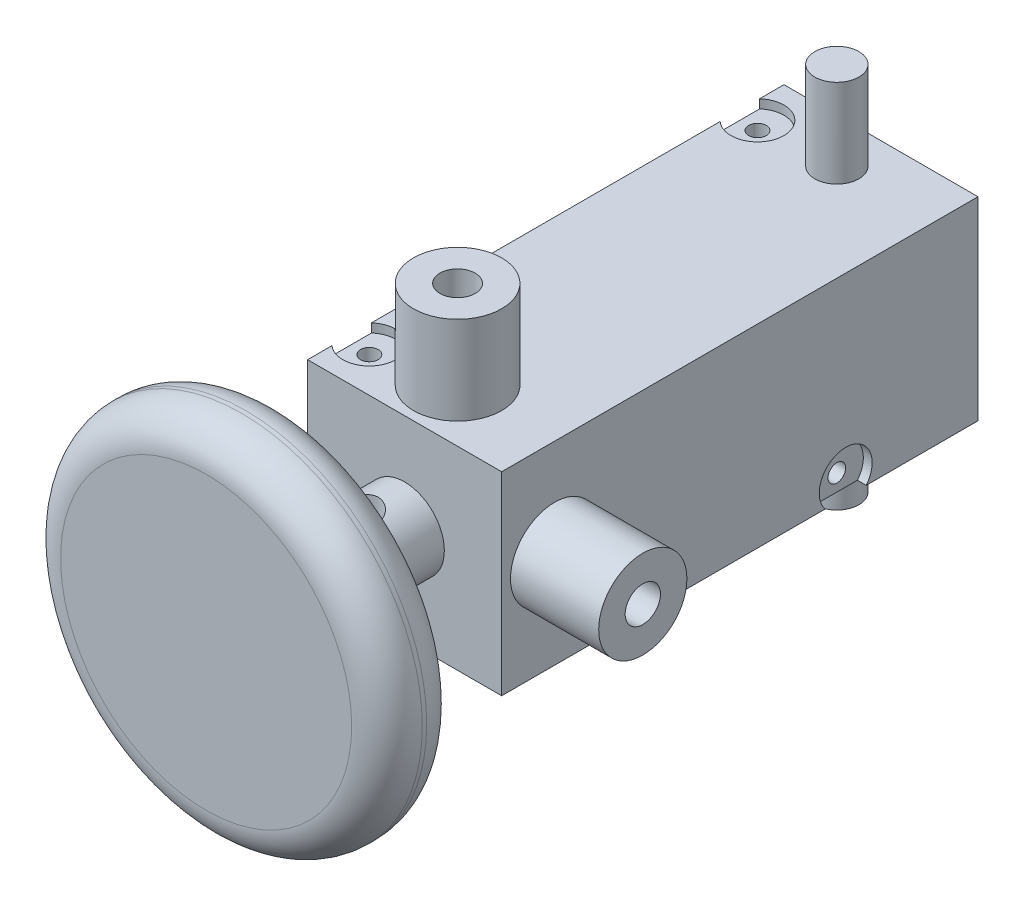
ISO-10303-21;
HEADER;
FILE_DESCRIPTION(('STEP AP214'),'2;1');
FILE_NAME('part.step','',(''),(''),'','','');
FILE_SCHEMA(('AUTOMOTIVE_DESIGN { 1 0 10303 214 1 1 1 1 }'));
ENDSEC;
DATA;
#1=APPLICATION_CONTEXT('core data for automotive mechanical design processes');
#2=APPLICATION_PROTOCOL_DEFINITION('international standard','automotive_design',2000,#1);
#3=PRODUCT_CONTEXT('',#1,'mechanical');
#4=PRODUCT('Part','Part','',(#3));
#5=PRODUCT_RELATED_PRODUCT_CATEGORY('part','',(#4));
#6=PRODUCT_DEFINITION_FORMATION('','',#4);
#7=PRODUCT_DEFINITION_CONTEXT('part definition',#1,'design');
#8=PRODUCT_DEFINITION('design','',#6,#7);
#9=PRODUCT_DEFINITION_SHAPE('','',#8);
#10=(LENGTH_UNIT() NAMED_UNIT(*) SI_UNIT(.MILLI.,.METRE.));
#11=(NAMED_UNIT(*) PLANE_ANGLE_UNIT() SI_UNIT($,.RADIAN.));
#12=(NAMED_UNIT(*) SI_UNIT($,.STERADIAN.) SOLID_ANGLE_UNIT());
#13=UNCERTAINTY_MEASURE_WITH_UNIT(LENGTH_MEASURE(1.E-05),#10,'distance_accuracy_value','');
#14=(GEOMETRIC_REPRESENTATION_CONTEXT(3) GLOBAL_UNCERTAINTY_ASSIGNED_CONTEXT((#13)) GLOBAL_UNIT_ASSIGNED_CONTEXT((#10,
#11,#12)) REPRESENTATION_CONTEXT('',''));
#15=CARTESIAN_POINT('',(0.,0.,0.));
#16=DIRECTION('',(0.,0.,1.));
#17=DIRECTION('',(1.,0.,0.));
#18=AXIS2_PLACEMENT_3D('',#15,#16,#17);
#19=CARTESIAN_POINT('',(0.,22.,54.));
#20=DIRECTION('',(0.,-1.,0.));
#21=DIRECTION('',(0.,0.,-1.));
#22=AXIS2_PLACEMENT_3D('',#19,#20,#21);
#23=PLANE('',#22);
#24=CARTESIAN_POINT('',(-11.,22.,5.));
#25=DIRECTION('',(0.,-1.,0.));
#26=DIRECTION('',(0.,0.,-1.));
#27=AXIS2_PLACEMENT_3D('',#24,#25,#26);
#28=CIRCLE('',#27,2.5);
#29=CARTESIAN_POINT('',(-11.,22.,2.5));
#30=VERTEX_POINT('',#29);
#31=EDGE_CURVE('E415',#30,#30,#28,.F.);
#32=ORIENTED_EDGE('',*,*,#31,.F.);
#33=EDGE_LOOP('',(#32));
#34=FACE_BOUND('',#33,.T.);
#35=CARTESIAN_POINT('',(-11.,22.,48.));
#36=DIRECTION('',(0.,-1.,0.));
#37=DIRECTION('',(0.,0.,-1.));
#38=AXIS2_PLACEMENT_3D('',#35,#36,#37);
#39=CIRCLE('',#38,5.);
#40=CARTESIAN_POINT('',(-11.,22.,43.));
#41=VERTEX_POINT('',#40);
#42=EDGE_CURVE('E480',#41,#41,#39,.F.);
#43=ORIENTED_EDGE('',*,*,#42,.F.);
#44=EDGE_LOOP('',(#43));
#45=FACE_BOUND('',#44,.T.);
#46=CARTESIAN_POINT('',(-20.,22.,5.));
#47=DIRECTION('',(0.,-1.,0.));
#48=DIRECTION('',(1.,0.,0.));
#49=AXIS2_PLACEMENT_3D('',#46,#47,#48);
#50=CIRCLE('',#49,3.);
#51=CARTESIAN_POINT('',(-22.,22.,2.7639320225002));
#52=VERTEX_POINT('',#51);
#53=CARTESIAN_POINT('',(-22.,22.,7.23606797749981));
#54=VERTEX_POINT('',#53);
#55=EDGE_CURVE('E284',#52,#54,#50,.T.);
#56=ORIENTED_EDGE('',*,*,#55,.T.);
#57=DIRECTION('',(0.,0.,-1.));
#58=VECTOR('',#57,1.);
#59=CARTESIAN_POINT('',(-22.,22.,54.));
#60=LINE('',#59,#58);
#61=CARTESIAN_POINT('',(-22.,22.,46.7639320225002));
#62=VERTEX_POINT('',#61);
#63=EDGE_CURVE('E461',#62,#54,#60,.T.);
#64=ORIENTED_EDGE('',*,*,#63,.F.);
#65=CARTESIAN_POINT('',(-20.,22.,49.));
#66=DIRECTION('',(0.,-1.,0.));
#67=DIRECTION('',(1.,0.,0.));
#68=AXIS2_PLACEMENT_3D('',#65,#66,#67);
#69=CIRCLE('',#68,3.);
#70=CARTESIAN_POINT('',(-22.,22.,51.2360679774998));
#71=VERTEX_POINT('',#70);
#72=EDGE_CURVE('E290',#62,#71,#69,.T.);
#73=ORIENTED_EDGE('',*,*,#72,.T.);
#74=CARTESIAN_POINT('',(-22.,22.,54.));
#75=VERTEX_POINT('',#74);
#76=EDGE_CURVE('E457',#75,#71,#60,.T.);
#77=ORIENTED_EDGE('',*,*,#76,.F.);
#78=DIRECTION('',(-1.,0.,0.));
#79=VECTOR('',#78,1.);
#80=CARTESIAN_POINT('',(0.,22.,54.));
#81=LINE('',#80,#79);
#82=CARTESIAN_POINT('',(0.,22.,54.));
#83=VERTEX_POINT('',#82);
#84=EDGE_CURVE('E440',#83,#75,#81,.T.);
#85=ORIENTED_EDGE('',*,*,#84,.F.);
#86=DIRECTION('',(0.,0.,-1.));
#87=VECTOR('',#86,1.);
#88=CARTESIAN_POINT('',(0.,22.,54.));
#89=LINE('',#88,#87);
#90=CARTESIAN_POINT('',(0.,22.,0.));
#91=VERTEX_POINT('',#90);
#92=EDGE_CURVE('E460',#83,#91,#89,.T.);
#93=ORIENTED_EDGE('',*,*,#92,.T.);
#94=DIRECTION('',(-1.,0.,0.));
#95=VECTOR('',#94,1.);
#96=CARTESIAN_POINT('',(0.,22.,0.));
#97=LINE('',#96,#95);
#98=CARTESIAN_POINT('',(-22.,22.,0.));
#99=VERTEX_POINT('',#98);
#100=EDGE_CURVE('E428',#91,#99,#97,.T.);
#101=ORIENTED_EDGE('',*,*,#100,.T.);
#102=EDGE_CURVE('E455',#52,#99,#60,.T.);
#103=ORIENTED_EDGE('',*,*,#102,.F.);
#104=EDGE_LOOP('',(#56,#64,#73,#77,#85,#93,#101,#103));
#105=FACE_BOUND('',#104,.T.);
#106=ADVANCED_FACE('F26',(#34,#45,#105),#23,.F.);
#107=CARTESIAN_POINT('',(-22.,0.,54.));
#108=DIRECTION('',(1.,0.,0.));
#109=DIRECTION('',(0.,1.,0.));
#110=AXIS2_PLACEMENT_3D('',#107,#108,#109);
#111=PLANE('',#110);
#112=CARTESIAN_POINT('',(-22.,3.00000000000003,46.5));
#113=DIRECTION('',(-1.,0.,0.));
#114=DIRECTION('',(0.,0.,1.));
#115=AXIS2_PLACEMENT_3D('',#112,#113,#114);
#116=CIRCLE('',#115,0.999999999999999);
#117=CARTESIAN_POINT('',(-22.,3.00000000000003,47.5));
#118=VERTEX_POINT('',#117);
#119=EDGE_CURVE('E337',#118,#118,#116,.T.);
#120=ORIENTED_EDGE('',*,*,#119,.F.);
#121=EDGE_LOOP('',(#120));
#122=FACE_BOUND('',#121,.T.);
#123=CARTESIAN_POINT('',(-22.,19.,30.5));
#124=DIRECTION('',(-1.,0.,0.));
#125=DIRECTION('',(0.,0.,1.));
#126=AXIS2_PLACEMENT_3D('',#123,#124,#125);
#127=CIRCLE('',#126,0.999999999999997);
#128=CARTESIAN_POINT('',(-22.,19.,31.5));
#129=VERTEX_POINT('',#128);
#130=EDGE_CURVE('E349',#129,#129,#127,.T.);
#131=ORIENTED_EDGE('',*,*,#130,.F.);
#132=EDGE_LOOP('',(#131));
#133=FACE_BOUND('',#132,.T.);
#134=CARTESIAN_POINT('',(-22.,19.0000000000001,23.5000000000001));
#135=DIRECTION('',(-1.,0.,0.));
#136=DIRECTION('',(0.,0.,1.));
#137=AXIS2_PLACEMENT_3D('',#134,#135,#136);
#138=CIRCLE('',#137,0.999999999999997);
#139=CARTESIAN_POINT('',(-22.,19.0000000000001,24.5000000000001));
#140=VERTEX_POINT('',#139);
#141=EDGE_CURVE('E361',#140,#140,#138,.T.);
#142=ORIENTED_EDGE('',*,*,#141,.F.);
#143=EDGE_LOOP('',(#142));
#144=FACE_BOUND('',#143,.T.);
#145=CARTESIAN_POINT('',(-22.,3.00000000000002,7.5));
#146=DIRECTION('',(-1.,0.,0.));
#147=DIRECTION('',(0.,0.,1.));
#148=AXIS2_PLACEMENT_3D('',#145,#146,#147);
#149=CIRCLE('',#148,0.999999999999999);
#150=CARTESIAN_POINT('',(-22.,3.00000000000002,8.5));
#151=VERTEX_POINT('',#150);
#152=EDGE_CURVE('E373',#151,#151,#149,.T.);
#153=ORIENTED_EDGE('',*,*,#152,.F.);
#154=EDGE_LOOP('',(#153));
#155=FACE_BOUND('',#154,.T.);
#156=DIRECTION('',(0.,1.,0.));
#157=VECTOR('',#156,1.);
#158=CARTESIAN_POINT('',(-22.,21.,2.7639320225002));
#159=LINE('',#158,#157);
#160=CARTESIAN_POINT('',(-22.,21.,2.7639320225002));
#161=VERTEX_POINT('',#160);
#162=EDGE_CURVE('E650',#52,#161,#159,.F.);
#163=ORIENTED_EDGE('',*,*,#162,.F.);
#164=ORIENTED_EDGE('',*,*,#102,.T.);
#165=DIRECTION('',(0.,-1.,0.));
#166=VECTOR('',#165,1.);
#167=CARTESIAN_POINT('',(-22.,0.,0.));
#168=LINE('',#167,#166);
#169=CARTESIAN_POINT('',(-22.,0.,0.));
#170=VERTEX_POINT('',#169);
#171=EDGE_CURVE('E431',#99,#170,#168,.T.);
#172=ORIENTED_EDGE('',*,*,#171,.T.);
#173=DIRECTION('',(0.,0.,-1.));
#174=VECTOR('',#173,1.);
#175=CARTESIAN_POINT('',(-22.,0.,54.));
#176=LINE('',#175,#174);
#177=CARTESIAN_POINT('',(-22.,0.,2.76393202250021));
#178=VERTEX_POINT('',#177);
#179=EDGE_CURVE('E450',#178,#170,#176,.T.);
#180=ORIENTED_EDGE('',*,*,#179,.F.);
#181=DIRECTION('',(0.,-1.,0.));
#182=VECTOR('',#181,1.);
#183=CARTESIAN_POINT('',(-22.,1.,2.76393202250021));
#184=LINE('',#183,#182);
#185=CARTESIAN_POINT('',(-22.,0.999999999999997,2.76393202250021));
#186=VERTEX_POINT('',#185);
#187=EDGE_CURVE('E687',#178,#186,#184,.F.);
#188=ORIENTED_EDGE('',*,*,#187,.T.);
#189=DIRECTION('',(0.,0.,-1.));
#190=VECTOR('',#189,1.);
#191=CARTESIAN_POINT('',(-22.,0.999999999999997,54.));
#192=LINE('',#191,#190);
#193=CARTESIAN_POINT('',(-22.,0.999999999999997,7.23606797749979));
#194=VERTEX_POINT('',#193);
#195=EDGE_CURVE('E689',#194,#186,#192,.T.);
#196=ORIENTED_EDGE('',*,*,#195,.F.);
#197=DIRECTION('',(0.,-1.,0.));
#198=VECTOR('',#197,1.);
#199=CARTESIAN_POINT('',(-22.,1.,7.23606797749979));
#200=LINE('',#199,#198);
#201=CARTESIAN_POINT('',(-22.,0.,7.23606797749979));
#202=VERTEX_POINT('',#201);
#203=EDGE_CURVE('E684',#194,#202,#200,.T.);
#204=ORIENTED_EDGE('',*,*,#203,.T.);
#205=CARTESIAN_POINT('',(-22.,0.,46.7639320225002));
#206=VERTEX_POINT('',#205);
#207=EDGE_CURVE('E456',#206,#202,#176,.T.);
#208=ORIENTED_EDGE('',*,*,#207,.F.);
#209=DIRECTION('',(0.,-1.,0.));
#210=VECTOR('',#209,1.);
#211=CARTESIAN_POINT('',(-22.,1.,46.7639320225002));
#212=LINE('',#211,#210);
#213=CARTESIAN_POINT('',(-22.,0.999999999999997,46.7639320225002));
#214=VERTEX_POINT('',#213);
#215=EDGE_CURVE('E694',#206,#214,#212,.F.);
#216=ORIENTED_EDGE('',*,*,#215,.T.);
#217=DIRECTION('',(0.,0.,-1.));
#218=VECTOR('',#217,1.);
#219=CARTESIAN_POINT('',(-22.,0.999999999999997,54.));
#220=LINE('',#219,#218);
#221=CARTESIAN_POINT('',(-22.,0.999999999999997,51.2360679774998));
#222=VERTEX_POINT('',#221);
#223=EDGE_CURVE('E697',#222,#214,#220,.T.);
#224=ORIENTED_EDGE('',*,*,#223,.F.);
#225=DIRECTION('',(0.,-1.,0.));
#226=VECTOR('',#225,1.);
#227=CARTESIAN_POINT('',(-22.,1.,51.2360679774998));
#228=LINE('',#227,#226);
#229=CARTESIAN_POINT('',(-22.,0.,51.2360679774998));
#230=VERTEX_POINT('',#229);
#231=EDGE_CURVE('E691',#222,#230,#228,.T.);
#232=ORIENTED_EDGE('',*,*,#231,.T.);
#233=CARTESIAN_POINT('',(-22.,0.,54.));
#234=VERTEX_POINT('',#233);
#235=EDGE_CURVE('E452',#234,#230,#176,.T.);
#236=ORIENTED_EDGE('',*,*,#235,.F.);
#237=DIRECTION('',(0.,-1.,0.));
#238=VECTOR('',#237,1.);
#239=CARTESIAN_POINT('',(-22.,0.,54.));
#240=LINE('',#239,#238);
#241=EDGE_CURVE('E442',#75,#234,#240,.T.);
#242=ORIENTED_EDGE('',*,*,#241,.F.);
#243=ORIENTED_EDGE('',*,*,#76,.T.);
#244=DIRECTION('',(0.,1.,0.));
#245=VECTOR('',#244,1.);
#246=CARTESIAN_POINT('',(-22.,21.,51.2360679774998));
#247=LINE('',#246,#245);
#248=CARTESIAN_POINT('',(-22.,21.,51.2360679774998));
#249=VERTEX_POINT('',#248);
#250=EDGE_CURVE('E680',#249,#71,#247,.T.);
#251=ORIENTED_EDGE('',*,*,#250,.F.);
#252=DIRECTION('',(0.,0.,1.));
#253=VECTOR('',#252,1.);
#254=CARTESIAN_POINT('',(-22.,21.,54.));
#255=LINE('',#254,#253);
#256=CARTESIAN_POINT('',(-22.,21.,46.7639320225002));
#257=VERTEX_POINT('',#256);
#258=EDGE_CURVE('E682',#257,#249,#255,.T.);
#259=ORIENTED_EDGE('',*,*,#258,.F.);
#260=DIRECTION('',(0.,1.,0.));
#261=VECTOR('',#260,1.);
#262=CARTESIAN_POINT('',(-22.,21.,46.7639320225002));
#263=LINE('',#262,#261);
#264=EDGE_CURVE('E677',#62,#257,#263,.F.);
#265=ORIENTED_EDGE('',*,*,#264,.F.);
#266=ORIENTED_EDGE('',*,*,#63,.T.);
#267=DIRECTION('',(0.,1.,0.));
#268=VECTOR('',#267,1.);
#269=CARTESIAN_POINT('',(-22.,21.,7.23606797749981));
#270=LINE('',#269,#268);
#271=CARTESIAN_POINT('',(-22.,21.,7.23606797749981));
#272=VERTEX_POINT('',#271);
#273=EDGE_CURVE('E673',#272,#54,#270,.T.);
#274=ORIENTED_EDGE('',*,*,#273,.F.);
#275=DIRECTION('',(0.,0.,1.));
#276=VECTOR('',#275,1.);
#277=CARTESIAN_POINT('',(-22.,21.,54.));
#278=LINE('',#277,#276);
#279=EDGE_CURVE('E675',#161,#272,#278,.T.);
#280=ORIENTED_EDGE('',*,*,#279,.F.);
#281=EDGE_LOOP('',(#163,#164,#172,#180,#188,#196,#204,#208,#216,#224,#232,#236,#242,#243,#251,
#259,#265,#266,#274,#280));
#282=FACE_BOUND('',#281,.T.);
#283=ADVANCED_FACE('F603',(#122,#133,#144,#155,#282),#111,.F.);
#284=CARTESIAN_POINT('',(-11.,32.,48.));
#285=DIRECTION('',(0.,1.,0.));
#286=DIRECTION('',(0.,0.,1.));
#287=AXIS2_PLACEMENT_3D('',#284,#285,#286);
#288=CYLINDRICAL_SURFACE('',#287,2.);
#289=CARTESIAN_POINT('',(-11.,32.,48.));
#290=DIRECTION('',(0.,1.,0.));
#291=DIRECTION('',(0.,0.,1.));
#292=AXIS2_PLACEMENT_3D('',#289,#290,#291);
#293=CIRCLE('',#292,2.);
#294=CARTESIAN_POINT('',(-11.,32.,50.));
#295=VERTEX_POINT('',#294);
#296=EDGE_CURVE('E399',#295,#295,#293,.T.);
#297=ORIENTED_EDGE('',*,*,#296,.T.);
#298=EDGE_LOOP('',(#297));
#299=FACE_BOUND('',#298,.T.);
#300=CARTESIAN_POINT('',(-11.,11.,48.));
#301=DIRECTION('',(-0.707106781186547,0.707106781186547,0.));
#302=DIRECTION('',(0.707106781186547,0.707106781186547,0.));
#303=AXIS2_PLACEMENT_3D('',#300,#301,#302);
#304=ELLIPSE('',#303,2.82842712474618,2.);
#305=CARTESIAN_POINT('',(-11.,11.,46.));
#306=VERTEX_POINT('',#305);
#307=CARTESIAN_POINT('',(-11.,11.,50.));
#308=VERTEX_POINT('',#307);
#309=EDGE_CURVE('E483',#306,#308,#304,.F.);
#310=ORIENTED_EDGE('',*,*,#309,.T.);
#311=CARTESIAN_POINT('',(-11.,11.,48.));
#312=DIRECTION('',(0.707106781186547,0.707106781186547,0.));
#313=DIRECTION('',(-0.707106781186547,0.707106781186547,0.));
#314=AXIS2_PLACEMENT_3D('',#311,#312,#313);
#315=ELLIPSE('',#314,2.82842712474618,2.);
#316=EDGE_CURVE('E491',#308,#306,#315,.F.);
#317=ORIENTED_EDGE('',*,*,#316,.T.);
#318=EDGE_LOOP('',(#310,#317));
#319=FACE_BOUND('',#318,.T.);
#320=ADVANCED_FACE('F551',(#299,#319),#288,.F.);
#321=CARTESIAN_POINT('',(0.,0.,54.));
#322=DIRECTION('',(-1.,0.,0.));
#323=DIRECTION('',(0.,0.,1.));
#324=AXIS2_PLACEMENT_3D('',#321,#322,#323);
#325=PLANE('',#324);
#326=DIRECTION('',(0.,0.,-1.));
#327=VECTOR('',#326,1.);
#328=CARTESIAN_POINT('',(0.,0.,54.));
#329=LINE('',#328,#327);
#330=CARTESIAN_POINT('',(0.,0.,54.));
#331=VERTEX_POINT('',#330);
#332=CARTESIAN_POINT('',(0.,0.,40.3294612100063));
#333=VERTEX_POINT('',#332);
#334=EDGE_CURVE('E447',#331,#333,#329,.T.);
#335=ORIENTED_EDGE('',*,*,#334,.T.);
#336=CARTESIAN_POINT('',(0.,1.89039955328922,38.));
#337=DIRECTION('',(1.,0.,0.));
#338=DIRECTION('',(0.,0.,-1.));
#339=AXIS2_PLACEMENT_3D('',#336,#337,#338);
#340=CIRCLE('',#339,3.);
#341=CARTESIAN_POINT('',(0.,0.,35.6705387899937));
#342=VERTEX_POINT('',#341);
#343=EDGE_CURVE('E277',#342,#333,#340,.T.);
#344=ORIENTED_EDGE('',*,*,#343,.F.);
#345=CARTESIAN_POINT('',(0.,0.,17.3294612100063));
#346=VERTEX_POINT('',#345);
#347=EDGE_CURVE('E451',#342,#346,#329,.T.);
#348=ORIENTED_EDGE('',*,*,#347,.T.);
#349=CARTESIAN_POINT('',(0.,1.89039955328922,15.));
#350=DIRECTION('',(1.,0.,0.));
#351=DIRECTION('',(0.,0.,-1.));
#352=AXIS2_PLACEMENT_3D('',#349,#350,#351);
#353=CIRCLE('',#352,3.);
#354=CARTESIAN_POINT('',(0.,0.,12.6705387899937));
#355=VERTEX_POINT('',#354);
#356=EDGE_CURVE('E280',#355,#346,#353,.T.);
#357=ORIENTED_EDGE('',*,*,#356,.F.);
#358=CARTESIAN_POINT('',(0.,0.,0.));
#359=VERTEX_POINT('',#358);
#360=EDGE_CURVE('E446',#355,#359,#329,.T.);
#361=ORIENTED_EDGE('',*,*,#360,.T.);
#362=DIRECTION('',(0.,1.,0.));
#363=VECTOR('',#362,1.);
#364=CARTESIAN_POINT('',(0.,0.,0.));
#365=LINE('',#364,#363);
#366=EDGE_CURVE('E425',#359,#91,#365,.T.);
#367=ORIENTED_EDGE('',*,*,#366,.T.);
#368=ORIENTED_EDGE('',*,*,#92,.F.);
#369=DIRECTION('',(0.,1.,0.));
#370=VECTOR('',#369,1.);
#371=CARTESIAN_POINT('',(0.,0.,54.));
#372=LINE('',#371,#370);
#373=EDGE_CURVE('E437',#331,#83,#372,.T.);
#374=ORIENTED_EDGE('',*,*,#373,.F.);
#375=EDGE_LOOP('',(#335,#344,#348,#357,#361,#367,#368,#374));
#376=FACE_BOUND('',#375,.T.);
#377=CARTESIAN_POINT('',(0.,11.,48.));
#378=DIRECTION('',(-1.,0.,0.));
#379=DIRECTION('',(0.,0.,1.));
#380=AXIS2_PLACEMENT_3D('',#377,#378,#379);
#381=CIRCLE('',#380,5.);
#382=CARTESIAN_POINT('',(0.,11.,53.));
#383=VERTEX_POINT('',#382);
#384=EDGE_CURVE('E418',#383,#383,#381,.F.);
#385=ORIENTED_EDGE('',*,*,#384,.F.);
#386=EDGE_LOOP('',(#385));
#387=FACE_BOUND('',#386,.T.);
#388=ADVANCED_FACE('F28',(#376,#387),#325,.F.);
#389=CARTESIAN_POINT('',(0.,0.,54.));
#390=DIRECTION('',(0.,1.,0.));
#391=DIRECTION('',(-1.,0.,0.));
#392=AXIS2_PLACEMENT_3D('',#389,#390,#391);
#393=PLANE('',#392);
#394=CARTESIAN_POINT('',(-2.99999999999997,0.,18.5));
#395=DIRECTION('',(0.,-1.,0.));
#396=DIRECTION('',(0.,0.,-1.));
#397=AXIS2_PLACEMENT_3D('',#394,#395,#396);
#398=CIRCLE('',#397,0.999999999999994);
#399=CARTESIAN_POINT('',(-2.99999999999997,0.,17.5000000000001));
#400=VERTEX_POINT('',#399);
#401=EDGE_CURVE('E313',#400,#400,#398,.T.);
#402=ORIENTED_EDGE('',*,*,#401,.F.);
#403=EDGE_LOOP('',(#402));
#404=FACE_BOUND('',#403,.T.);
#405=CARTESIAN_POINT('',(-19.,0.,34.5000000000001));
#406=DIRECTION('',(0.,-1.,0.));
#407=DIRECTION('',(0.,0.,-1.));
#408=AXIS2_PLACEMENT_3D('',#405,#406,#407);
#409=CIRCLE('',#408,0.999999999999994);
#410=CARTESIAN_POINT('',(-19.,0.,33.5000000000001));
#411=VERTEX_POINT('',#410);
#412=EDGE_CURVE('E325',#411,#411,#409,.T.);
#413=ORIENTED_EDGE('',*,*,#412,.F.);
#414=EDGE_LOOP('',(#413));
#415=FACE_BOUND('',#414,.T.);
#416=DIRECTION('',(0.,0.,-1.));
#417=VECTOR('',#416,1.);
#418=CARTESIAN_POINT('',(-1.,0.,54.));
#419=LINE('',#418,#417);
#420=CARTESIAN_POINT('',(-1.,0.,40.3294612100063));
#421=VERTEX_POINT('',#420);
#422=CARTESIAN_POINT('',(-1.,0.,35.6705387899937));
#423=VERTEX_POINT('',#422);
#424=EDGE_CURVE('E660',#421,#423,#419,.T.);
#425=ORIENTED_EDGE('',*,*,#424,.F.);
#426=DIRECTION('',(1.,0.,0.));
#427=VECTOR('',#426,1.);
#428=CARTESIAN_POINT('',(-1.,0.,40.3294612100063));
#429=LINE('',#428,#427);
#430=EDGE_CURVE('E11',#421,#333,#429,.T.);
#431=ORIENTED_EDGE('',*,*,#430,.T.);
#432=ORIENTED_EDGE('',*,*,#334,.F.);
#433=DIRECTION('',(1.,0.,0.));
#434=VECTOR('',#433,1.);
#435=CARTESIAN_POINT('',(0.,0.,54.));
#436=LINE('',#435,#434);
#437=EDGE_CURVE('E444',#234,#331,#436,.T.);
#438=ORIENTED_EDGE('',*,*,#437,.F.);
#439=ORIENTED_EDGE('',*,*,#235,.T.);
#440=CARTESIAN_POINT('',(-20.,0.,49.));
#441=DIRECTION('',(0.,-1.,0.));
#442=DIRECTION('',(1.,0.,0.));
#443=AXIS2_PLACEMENT_3D('',#440,#441,#442);
#444=CIRCLE('',#443,3.);
#445=EDGE_CURVE('E300',#206,#230,#444,.T.);
#446=ORIENTED_EDGE('',*,*,#445,.F.);
#447=ORIENTED_EDGE('',*,*,#207,.T.);
#448=CARTESIAN_POINT('',(-20.,0.,5.));
#449=DIRECTION('',(0.,-1.,0.));
#450=DIRECTION('',(1.,0.,0.));
#451=AXIS2_PLACEMENT_3D('',#448,#449,#450);
#452=CIRCLE('',#451,3.);
#453=EDGE_CURVE('E296',#178,#202,#452,.T.);
#454=ORIENTED_EDGE('',*,*,#453,.F.);
#455=ORIENTED_EDGE('',*,*,#179,.T.);
#456=DIRECTION('',(1.,0.,0.));
#457=VECTOR('',#456,1.);
#458=CARTESIAN_POINT('',(0.,0.,0.));
#459=LINE('',#458,#457);
#460=EDGE_CURVE('E434',#170,#359,#459,.T.);
#461=ORIENTED_EDGE('',*,*,#460,.T.);
#462=ORIENTED_EDGE('',*,*,#360,.F.);
#463=DIRECTION('',(1.,0.,0.));
#464=VECTOR('',#463,1.);
#465=CARTESIAN_POINT('',(-1.,0.,12.6705387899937));
#466=LINE('',#465,#464);
#467=CARTESIAN_POINT('',(-1.,0.,12.6705387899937));
#468=VERTEX_POINT('',#467);
#469=EDGE_CURVE('E668',#355,#468,#466,.F.);
#470=ORIENTED_EDGE('',*,*,#469,.T.);
#471=DIRECTION('',(0.,0.,-1.));
#472=VECTOR('',#471,1.);
#473=CARTESIAN_POINT('',(-1.,0.,54.));
#474=LINE('',#473,#472);
#475=CARTESIAN_POINT('',(-1.,0.,17.3294612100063));
#476=VERTEX_POINT('',#475);
#477=EDGE_CURVE('E670',#476,#468,#474,.T.);
#478=ORIENTED_EDGE('',*,*,#477,.F.);
#479=DIRECTION('',(1.,0.,0.));
#480=VECTOR('',#479,1.);
#481=CARTESIAN_POINT('',(-1.,0.,17.3294612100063));
#482=LINE('',#481,#480);
#483=EDGE_CURVE('E663',#476,#346,#482,.T.);
#484=ORIENTED_EDGE('',*,*,#483,.T.);
#485=ORIENTED_EDGE('',*,*,#347,.F.);
#486=DIRECTION('',(1.,0.,0.));
#487=VECTOR('',#486,1.);
#488=CARTESIAN_POINT('',(-1.,0.,35.6705387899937));
#489=LINE('',#488,#487);
#490=EDGE_CURVE('E34',#342,#423,#489,.F.);
#491=ORIENTED_EDGE('',*,*,#490,.T.);
#492=EDGE_LOOP('',(#425,#431,#432,#438,#439,#446,#447,#454,#455,#461,#462,#470,#478,#484,#485,#491));
#493=FACE_BOUND('',#492,.T.);
#494=CARTESIAN_POINT('',(-11.,0.,5.));
#495=DIRECTION('',(0.,1.,0.));
#496=DIRECTION('',(-1.,0.,0.));
#497=AXIS2_PLACEMENT_3D('',#494,#495,#496);
#498=CIRCLE('',#497,2.5);
#499=CARTESIAN_POINT('',(-13.5,0.,5.));
#500=VERTEX_POINT('',#499);
#501=EDGE_CURVE('E419',#500,#500,#498,.F.);
#502=ORIENTED_EDGE('',*,*,#501,.F.);
#503=EDGE_LOOP('',(#502));
#504=FACE_BOUND('',#503,.T.);
#505=ADVANCED_FACE('F614',(#404,#415,#493,#504),#393,.F.);
#506=CARTESIAN_POINT('',(0.,22.,54.));
#507=DIRECTION('',(0.,0.,1.));
#508=DIRECTION('',(1.,0.,0.));
#509=AXIS2_PLACEMENT_3D('',#506,#507,#508);
#510=PLANE('',#509);
#511=ORIENTED_EDGE('',*,*,#373,.T.);
#512=ORIENTED_EDGE('',*,*,#84,.T.);
#513=ORIENTED_EDGE('',*,*,#241,.T.);
#514=ORIENTED_EDGE('',*,*,#437,.T.);
#515=EDGE_LOOP('',(#511,#512,#513,#514));
#516=FACE_BOUND('',#515,.T.);
#517=CARTESIAN_POINT('',(-11.,11.,54.));
#518=DIRECTION('',(0.,0.,1.));
#519=DIRECTION('',(1.,0.,0.));
#520=AXIS2_PLACEMENT_3D('',#517,#518,#519);
#521=CIRCLE('',#520,4.5);
#522=CARTESIAN_POINT('',(-6.5,11.,54.));
#523=VERTEX_POINT('',#522);
#524=EDGE_CURVE('E414',#523,#523,#521,.T.);
#525=ORIENTED_EDGE('',*,*,#524,.F.);
#526=EDGE_LOOP('',(#525));
#527=FACE_BOUND('',#526,.T.);
#528=ADVANCED_FACE('F617',(#516,#527),#510,.T.);
#529=CARTESIAN_POINT('',(0.,22.,0.));
#530=DIRECTION('',(0.,0.,1.));
#531=DIRECTION('',(1.,0.,0.));
#532=AXIS2_PLACEMENT_3D('',#529,#530,#531);
#533=PLANE('',#532);
#534=ORIENTED_EDGE('',*,*,#366,.F.);
#535=ORIENTED_EDGE('',*,*,#460,.F.);
#536=ORIENTED_EDGE('',*,*,#171,.F.);
#537=ORIENTED_EDGE('',*,*,#100,.F.);
#538=EDGE_LOOP('',(#534,#535,#536,#537));
#539=FACE_BOUND('',#538,.T.);
#540=ADVANCED_FACE('F620',(#539),#533,.F.);
#541=CARTESIAN_POINT('',(-11.,11.,68.));
#542=DIRECTION('',(0.,0.,-1.));
#543=DIRECTION('',(-1.,0.,0.));
#544=AXIS2_PLACEMENT_3D('',#541,#542,#543);
#545=CYLINDRICAL_SURFACE('',#544,4.5);
#546=CARTESIAN_POINT('',(-11.,15.5,61.));
#547=CARTESIAN_POINT('',(-11.1064917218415,15.4999959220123,60.9999950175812));
#548=CARTESIAN_POINT('',(-11.2131499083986,15.4961775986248,60.9914445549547));
#549=CARTESIAN_POINT('',(-11.423397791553,15.4812834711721,60.9575815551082));
#550=CARTESIAN_POINT('',(-11.5269794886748,15.4701902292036,60.9322287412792));
#551=CARTESIAN_POINT('',(-11.72770045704,15.4419239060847,60.8658995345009));
#552=CARTESIAN_POINT('',(-11.8248612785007,15.4247725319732,60.8249788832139));
#553=CARTESIAN_POINT('',(-12.0108318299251,15.3860294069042,60.7289247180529));
#554=CARTESIAN_POINT('',(-12.0996434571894,15.3644386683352,60.6737944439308));
#555=CARTESIAN_POINT('',(-12.2714798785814,15.3175999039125,60.5476651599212));
#556=CARTESIAN_POINT('',(-12.353981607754,15.2922218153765,60.4760023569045));
#557=CARTESIAN_POINT('',(-12.5062566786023,15.2411852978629,60.320251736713));
#558=CARTESIAN_POINT('',(-12.5760224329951,15.2155267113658,60.2361565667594));
#559=CARTESIAN_POINT('',(-12.7048460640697,15.1651604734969,60.0520612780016));
#560=CARTESIAN_POINT('',(-12.7630531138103,15.1405932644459,59.9514231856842));
#561=CARTESIAN_POINT('',(-12.8614805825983,15.0972921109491,59.7405447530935));
#562=CARTESIAN_POINT('',(-12.9017115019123,15.0785547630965,59.6303100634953));
#563=CARTESIAN_POINT('',(-12.9608115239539,15.0504622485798,59.4093796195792));
#564=CARTESIAN_POINT('',(-12.9806931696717,15.0406653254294,59.2990132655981));
#565=CARTESIAN_POINT('',(-13.0016782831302,15.0303146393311,59.0761102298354));
#566=CARTESIAN_POINT('',(-13.002794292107,15.02975470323,58.9635750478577));
#567=CARTESIAN_POINT('',(-12.9869716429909,15.0375727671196,58.7503045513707));
#568=CARTESIAN_POINT('',(-12.9716400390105,15.0451552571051,58.6494146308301));
#569=CARTESIAN_POINT('',(-12.9260810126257,15.0670436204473,58.4518247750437));
#570=CARTESIAN_POINT('',(-12.8958502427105,15.0813510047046,58.3551257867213));
#571=CARTESIAN_POINT('',(-12.8207520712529,15.1154085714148,58.1660663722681));
#572=CARTESIAN_POINT('',(-12.7755713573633,15.1352737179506,58.0738520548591));
#573=CARTESIAN_POINT('',(-12.6720811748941,15.1781907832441,57.8979240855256));
#574=CARTESIAN_POINT('',(-12.6137661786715,15.201244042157,57.8142140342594));
#575=CARTESIAN_POINT('',(-12.4790080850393,15.2506663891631,57.6490863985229));
#576=CARTESIAN_POINT('',(-12.4013524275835,15.2771397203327,57.5686865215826));
#577=CARTESIAN_POINT('',(-12.233438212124,15.3285489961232,57.4216825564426));
#578=CARTESIAN_POINT('',(-12.1431758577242,15.3534844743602,57.3550826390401));
#579=CARTESIAN_POINT('',(-11.9491527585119,15.3999244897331,57.235786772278));
#580=CARTESIAN_POINT('',(-11.845072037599,15.4213059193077,57.1835596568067));
#581=CARTESIAN_POINT('',(-11.6284074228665,15.4572558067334,57.0977230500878));
#582=CARTESIAN_POINT('',(-11.5158289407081,15.4718285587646,57.064101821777));
#583=CARTESIAN_POINT('',(-11.2938205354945,15.4916825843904,57.018688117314));
#584=CARTESIAN_POINT('',(-11.1847211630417,15.4975424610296,57.005533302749));
#585=CARTESIAN_POINT('',(-10.965722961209,15.5012000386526,56.9972968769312));
#586=CARTESIAN_POINT('',(-10.8558244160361,15.4990004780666,57.002209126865));
#587=CARTESIAN_POINT('',(-10.6450925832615,15.4871529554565,57.0290435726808));
#588=CARTESIAN_POINT('',(-10.5441035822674,15.4779451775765,57.0499608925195));
#589=CARTESIAN_POINT('',(-10.3472079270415,15.4535054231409,57.1067579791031));
#590=CARTESIAN_POINT('',(-10.2513018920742,15.4382727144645,57.1426395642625));
#591=CARTESIAN_POINT('',(-10.0638959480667,15.4026237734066,57.2294888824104));
#592=CARTESIAN_POINT('',(-9.97262684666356,15.3820606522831,57.2808923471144));
#593=CARTESIAN_POINT('',(-9.79968072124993,15.3378812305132,57.3968514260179));
#594=CARTESIAN_POINT('',(-9.71800789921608,15.314263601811,57.4614127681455));
#595=CARTESIAN_POINT('',(-9.55963278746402,15.2641279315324,57.6079167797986));
#596=CARTESIAN_POINT('',(-9.4838616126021,15.2375295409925,57.6908409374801));
#597=CARTESIAN_POINT('',(-9.34699757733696,15.1860413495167,57.8685553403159));
#598=CARTESIAN_POINT('',(-9.28590992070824,15.1611521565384,57.9633497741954));
#599=CARTESIAN_POINT('',(-9.17892426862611,15.1154779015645,58.1651243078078));
#600=CARTESIAN_POINT('',(-9.13341672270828,15.0948029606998,58.2723383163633));
#601=CARTESIAN_POINT('',(-9.0615350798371,15.0612750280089,58.4941268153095));
#602=CARTESIAN_POINT('',(-9.03514225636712,15.0484143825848,58.6086939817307));
#603=CARTESIAN_POINT('',(-9.0042145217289,15.0332505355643,58.8314815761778));
#604=CARTESIAN_POINT('',(-8.99801655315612,15.0301448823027,58.9394168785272));
#605=CARTESIAN_POINT('',(-9.00309225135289,15.0326628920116,59.1547596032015));
#606=CARTESIAN_POINT('',(-9.01436219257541,15.0382846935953,59.2621671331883));
#607=CARTESIAN_POINT('',(-9.05259773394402,15.056849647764,59.4666919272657));
#608=CARTESIAN_POINT('',(-9.07857827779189,15.0693319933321,59.5640395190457));
#609=CARTESIAN_POINT('',(-9.14445805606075,15.0997894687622,59.7529819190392));
#610=CARTESIAN_POINT('',(-9.18436131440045,15.1177661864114,59.844575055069));
#611=CARTESIAN_POINT('',(-9.27987890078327,15.1586105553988,60.0258376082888));
#612=CARTESIAN_POINT('',(-9.33633614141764,15.1817178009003,60.1150076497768));
#613=CARTESIAN_POINT('',(-9.46226405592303,15.2296458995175,60.2831248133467));
#614=CARTESIAN_POINT('',(-9.5317401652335,15.2544674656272,60.3620676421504));
#615=CARTESIAN_POINT('',(-9.68891859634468,15.3056323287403,60.5146224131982));
#616=CARTESIAN_POINT('',(-9.77768363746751,15.3319188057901,60.5871639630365));
#617=CARTESIAN_POINT('',(-9.96704865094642,15.3809319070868,60.716435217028));
#618=CARTESIAN_POINT('',(-10.0676540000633,15.4036569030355,60.7731576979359));
#619=CARTESIAN_POINT('',(-10.2769481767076,15.4427920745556,60.8682238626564));
#620=CARTESIAN_POINT('',(-10.3855327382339,15.4592707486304,60.9067681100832));
#621=CARTESIAN_POINT('',(-10.6083849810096,15.4843190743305,60.9646397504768));
#622=CARTESIAN_POINT('',(-10.7226341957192,15.4929128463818,60.9840257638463));
#623=CARTESIAN_POINT('',(-10.8646433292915,15.4980461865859,60.9955997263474));
#624=CARTESIAN_POINT('',(-10.8916800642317,15.4987776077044,60.9972482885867));
#625=CARTESIAN_POINT('',(-10.9458076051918,15.499755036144,60.9994490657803));
#626=CARTESIAN_POINT('',(-10.9728984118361,15.5000010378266,61.0000012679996));
#627=CARTESIAN_POINT('',(-11.,15.5,61.));
#628=B_SPLINE_CURVE_WITH_KNOTS('',3,(#546,#547,#548,#549,#550,#551,#552,#553,#554,#555,#556,
#557,#558,#559,#560,#561,#562,#563,#564,#565,#566,#567,#568,#569,#570,#571,#572,#573,#574,#575,
#576,#577,#578,#579,#580,#581,#582,#583,#584,#585,#586,#587,#588,#589,#590,#591,#592,#593,#594,
#595,#596,#597,#598,#599,#600,#601,#602,#603,#604,#605,#606,#607,#608,#609,#610,#611,#612,#613,
#614,#615,#616,#617,#618,#619,#620,#621,#622,#623,#624,#625,#626,#627),.UNSPECIFIED.,.T.,.F.,(4,
2,2,2,2,2,2,2,2,2,2,2,2,2,2,2,2,2,2,2,2,2,2,2,2,2,2,2,2,2,2,2,2,2,2,2,2,2,2,2,4),(0.,
0.319363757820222,0.639495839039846,0.958492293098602,1.27741608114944,1.61253910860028,
1.94786113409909,2.30254396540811,2.65701934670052,2.99284475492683,3.32844571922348,
3.63400850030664,3.93963996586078,4.25213185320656,4.5647555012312,4.90783346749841,
5.25101497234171,5.60433395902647,5.95742980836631,6.28582812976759,6.61411487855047,
6.92332786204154,7.23257843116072,7.55147695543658,7.87051460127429,8.21526516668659,
8.56013773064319,8.91311015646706,9.2657363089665,9.58847399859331,9.91114286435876,
10.214399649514,10.5177441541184,10.8405269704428,11.1634448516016,11.5146101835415,
11.8659356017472,12.2132884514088,12.5595751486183,12.6408506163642,12.7221270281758),.UNSPECIFIED.);
#629=CARTESIAN_POINT('',(-11.,15.5,57.));
#630=VERTEX_POINT('',#629);
#631=CARTESIAN_POINT('',(-11.,15.5,61.));
#632=VERTEX_POINT('',#631);
#633=EDGE_CURVE('E700',#630,#632,#628,.T.);
#634=ORIENTED_EDGE('',*,*,#633,.T.);
#635=EDGE_CURVE('E699',#632,#630,#628,.T.);
#636=ORIENTED_EDGE('',*,*,#635,.T.);
#637=EDGE_LOOP('',(#634,#636));
#638=FACE_BOUND('',#637,.T.);
#639=CARTESIAN_POINT('',(-11.,6.5,61.));
#640=CARTESIAN_POINT('',(-10.8935082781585,6.50000407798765,60.9999950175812));
#641=CARTESIAN_POINT('',(-10.7868500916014,6.50382240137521,60.9914445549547));
#642=CARTESIAN_POINT('',(-10.576602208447,6.51871652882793,60.9575815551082));
#643=CARTESIAN_POINT('',(-10.4730205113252,6.5298097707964,60.9322287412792));
#644=CARTESIAN_POINT('',(-10.27229954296,6.55807609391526,60.8658995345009));
#645=CARTESIAN_POINT('',(-10.1751387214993,6.57522746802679,60.8249788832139));
#646=CARTESIAN_POINT('',(-9.98916817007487,6.61397059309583,60.7289247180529));
#647=CARTESIAN_POINT('',(-9.90035654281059,6.63556133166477,60.6737944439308));
#648=CARTESIAN_POINT('',(-9.72852012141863,6.68240009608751,60.5476651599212));
#649=CARTESIAN_POINT('',(-9.64601839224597,6.70777818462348,60.4760023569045));
#650=CARTESIAN_POINT('',(-9.49374332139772,6.75881470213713,60.320251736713));
#651=CARTESIAN_POINT('',(-9.42397756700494,6.78447328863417,60.2361565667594));
#652=CARTESIAN_POINT('',(-9.29515393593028,6.83483952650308,60.0520612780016));
#653=CARTESIAN_POINT('',(-9.23694688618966,6.85940673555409,59.9514231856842));
#654=CARTESIAN_POINT('',(-9.13851941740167,6.90270788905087,59.7405447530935));
#655=CARTESIAN_POINT('',(-9.09828849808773,6.92144523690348,59.6303100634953));
#656=CARTESIAN_POINT('',(-9.03918847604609,6.94953775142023,59.4093796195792));
#657=CARTESIAN_POINT('',(-9.0193068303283,6.95933467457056,59.2990132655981));
#658=CARTESIAN_POINT('',(-8.99832171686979,6.96968536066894,59.0761102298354));
#659=CARTESIAN_POINT('',(-8.99720570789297,6.97024529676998,58.9635750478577));
#660=CARTESIAN_POINT('',(-9.01302835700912,6.96242723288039,58.7503045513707));
#661=CARTESIAN_POINT('',(-9.02835996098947,6.95484474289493,58.6494146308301));
#662=CARTESIAN_POINT('',(-9.07391898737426,6.93295637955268,58.4518247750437));
#663=CARTESIAN_POINT('',(-9.10414975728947,6.91864899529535,58.3551257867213));
#664=CARTESIAN_POINT('',(-9.1792479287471,6.88459142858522,58.1660663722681));
#665=CARTESIAN_POINT('',(-9.22442864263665,6.86472628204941,58.0738520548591));
#666=CARTESIAN_POINT('',(-9.32791882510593,6.82180921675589,57.8979240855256));
#667=CARTESIAN_POINT('',(-9.38623382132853,6.79875595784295,57.8142140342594));
#668=CARTESIAN_POINT('',(-9.52099191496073,6.74933361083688,57.6490863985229));
#669=CARTESIAN_POINT('',(-9.59864757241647,6.7228602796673,57.5686865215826));
#670=CARTESIAN_POINT('',(-9.76656178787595,6.67145100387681,57.4216825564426));
#671=CARTESIAN_POINT('',(-9.85682414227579,6.64651552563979,57.3550826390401));
#672=CARTESIAN_POINT('',(-10.0508472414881,6.60007551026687,57.235786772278));
#673=CARTESIAN_POINT('',(-10.154927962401,6.57869408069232,57.1835596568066));
#674=CARTESIAN_POINT('',(-10.3715925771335,6.54274419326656,57.0977230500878));
#675=CARTESIAN_POINT('',(-10.4841710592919,6.52817144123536,57.064101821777));
#676=CARTESIAN_POINT('',(-10.7061794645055,6.50831741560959,57.0186881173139));
#677=CARTESIAN_POINT('',(-10.8152788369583,6.50245753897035,57.005533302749));
#678=CARTESIAN_POINT('',(-11.034277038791,6.4987999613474,56.9972968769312));
#679=CARTESIAN_POINT('',(-11.1441755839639,6.50099952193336,57.002209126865));
#680=CARTESIAN_POINT('',(-11.3549074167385,6.51284704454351,57.0290435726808));
#681=CARTESIAN_POINT('',(-11.4558964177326,6.5220548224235,57.0499608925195));
#682=CARTESIAN_POINT('',(-11.6527920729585,6.54649457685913,57.1067579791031));
#683=CARTESIAN_POINT('',(-11.7486981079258,6.56172728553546,57.1426395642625));
#684=CARTESIAN_POINT('',(-11.9361040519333,6.59737622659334,57.2294888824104));
#685=CARTESIAN_POINT('',(-12.0273731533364,6.61793934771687,57.2808923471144));
#686=CARTESIAN_POINT('',(-12.2003192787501,6.66211876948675,57.3968514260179));
#687=CARTESIAN_POINT('',(-12.2819921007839,6.68573639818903,57.4614127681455));
#688=CARTESIAN_POINT('',(-12.440367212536,6.73587206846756,57.6079167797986));
#689=CARTESIAN_POINT('',(-12.5161383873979,6.76247045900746,57.6908409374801));
#690=CARTESIAN_POINT('',(-12.653002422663,6.81395865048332,57.8685553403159));
#691=CARTESIAN_POINT('',(-12.7140900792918,6.83884784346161,57.9633497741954));
#692=CARTESIAN_POINT('',(-12.8210757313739,6.88452209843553,58.1651243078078));
#693=CARTESIAN_POINT('',(-12.8665832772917,6.90519703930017,58.2723383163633));
#694=CARTESIAN_POINT('',(-12.9384649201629,6.9387249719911,58.4941268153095));
#695=CARTESIAN_POINT('',(-12.9648577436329,6.95158561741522,58.6086939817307));
#696=CARTESIAN_POINT('',(-12.9957854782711,6.96674946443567,58.8314815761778));
#697=CARTESIAN_POINT('',(-13.0019834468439,6.96985511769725,58.9394168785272));
#698=CARTESIAN_POINT('',(-12.9969077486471,6.96733710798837,59.1547596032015));
#699=CARTESIAN_POINT('',(-12.9856378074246,6.96171530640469,59.2621671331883));
#700=CARTESIAN_POINT('',(-12.947402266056,6.943150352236,59.4666919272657));
#701=CARTESIAN_POINT('',(-12.9214217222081,6.93066800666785,59.5640395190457));
#702=CARTESIAN_POINT('',(-12.8555419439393,6.9002105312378,59.7529819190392));
#703=CARTESIAN_POINT('',(-12.8156386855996,6.88223381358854,59.844575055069));
#704=CARTESIAN_POINT('',(-12.7201210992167,6.84138944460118,60.0258376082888));
#705=CARTESIAN_POINT('',(-12.6636638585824,6.81828219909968,60.1150076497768));
#706=CARTESIAN_POINT('',(-12.537735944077,6.77035410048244,60.2831248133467));
#707=CARTESIAN_POINT('',(-12.4682598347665,6.74553253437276,60.3620676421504));
#708=CARTESIAN_POINT('',(-12.3110814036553,6.69436767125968,60.5146224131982));
#709=CARTESIAN_POINT('',(-12.2223163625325,6.66808119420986,60.5871639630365));
#710=CARTESIAN_POINT('',(-12.0329513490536,6.61906809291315,60.716435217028));
#711=CARTESIAN_POINT('',(-11.9323459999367,6.59634309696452,60.7731576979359));
#712=CARTESIAN_POINT('',(-11.7230518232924,6.55720792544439,60.8682238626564));
#713=CARTESIAN_POINT('',(-11.6144672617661,6.54072925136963,60.9067681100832));
#714=CARTESIAN_POINT('',(-11.3916150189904,6.51568092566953,60.9646397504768));
#715=CARTESIAN_POINT('',(-11.2773658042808,6.50708715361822,60.9840257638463));
#716=CARTESIAN_POINT('',(-11.1353566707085,6.5019538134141,60.9955997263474));
#717=CARTESIAN_POINT('',(-11.1083199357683,6.50122239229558,60.9972482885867));
#718=CARTESIAN_POINT('',(-11.0541923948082,6.50024496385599,60.9994490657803));
#719=CARTESIAN_POINT('',(-11.0271015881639,6.49999896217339,61.0000012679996));
#720=CARTESIAN_POINT('',(-11.,6.5,61.));
#721=B_SPLINE_CURVE_WITH_KNOTS('',3,(#639,#640,#641,#642,#643,#644,#645,#646,#647,#648,#649,
#650,#651,#652,#653,#654,#655,#656,#657,#658,#659,#660,#661,#662,#663,#664,#665,#666,#667,#668,
#669,#670,#671,#672,#673,#674,#675,#676,#677,#678,#679,#680,#681,#682,#683,#684,#685,#686,#687,
#688,#689,#690,#691,#692,#693,#694,#695,#696,#697,#698,#699,#700,#701,#702,#703,#704,#705,#706,
#707,#708,#709,#710,#711,#712,#713,#714,#715,#716,#717,#718,#719,#720),.UNSPECIFIED.,.T.,.F.,(4,
2,2,2,2,2,2,2,2,2,2,2,2,2,2,2,2,2,2,2,2,2,2,2,2,2,2,2,2,2,2,2,2,2,2,2,2,2,2,2,4),(0.,
0.319363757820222,0.639495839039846,0.958492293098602,1.27741608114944,1.61253910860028,
1.94786113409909,2.30254396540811,2.65701934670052,2.99284475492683,3.32844571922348,
3.63400850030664,3.93963996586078,4.25213185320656,4.5647555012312,4.9078334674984,
5.25101497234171,5.60433395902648,5.95742980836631,6.28582812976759,6.61411487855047,
6.92332786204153,7.23257843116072,7.55147695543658,7.87051460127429,8.21526516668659,
8.56013773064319,8.91311015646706,9.2657363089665,9.5884739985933,9.91114286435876,
10.214399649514,10.5177441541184,10.8405269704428,11.1634448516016,11.5146101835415,
11.8659356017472,12.2132884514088,12.5595751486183,12.6408506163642,12.7221270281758),.UNSPECIFIED.);
#722=CARTESIAN_POINT('',(-11.,6.5,61.));
#723=VERTEX_POINT('',#722);
#724=EDGE_CURVE('E376',#723,#723,#721,.T.);
#725=ORIENTED_EDGE('',*,*,#724,.T.);
#726=EDGE_LOOP('',(#725));
#727=FACE_BOUND('',#726,.T.);
#728=CARTESIAN_POINT('',(-6.5,11.,61.5));
#729=CARTESIAN_POINT('',(-6.50000407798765,10.8935082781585,61.5000049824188));
#730=CARTESIAN_POINT('',(-6.50382240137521,10.7868500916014,61.5085554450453));
#731=CARTESIAN_POINT('',(-6.51871652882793,10.576602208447,61.5424184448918));
#732=CARTESIAN_POINT('',(-6.5298097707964,10.4730205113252,61.5677712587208));
#733=CARTESIAN_POINT('',(-6.55807609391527,10.27229954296,61.6341004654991));
#734=CARTESIAN_POINT('',(-6.5752274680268,10.1751387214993,61.6750211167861));
#735=CARTESIAN_POINT('',(-6.61397059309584,9.98916817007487,61.7710752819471));
#736=CARTESIAN_POINT('',(-6.63556133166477,9.90035654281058,61.8262055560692));
#737=CARTESIAN_POINT('',(-6.68240009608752,9.72852012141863,61.9523348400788));
#738=CARTESIAN_POINT('',(-6.70777818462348,9.64601839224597,62.0239976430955));
#739=CARTESIAN_POINT('',(-6.75881470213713,9.49374332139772,62.179748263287));
#740=CARTESIAN_POINT('',(-6.78447328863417,9.42397756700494,62.2638434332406));
#741=CARTESIAN_POINT('',(-6.83483952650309,9.29515393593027,62.4479387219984));
#742=CARTESIAN_POINT('',(-6.85940673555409,9.23694688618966,62.5485768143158));
#743=CARTESIAN_POINT('',(-6.90270788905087,9.13851941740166,62.7594552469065));
#744=CARTESIAN_POINT('',(-6.92144523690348,9.09828849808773,62.8696899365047));
#745=CARTESIAN_POINT('',(-6.94953775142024,9.03918847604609,63.0906203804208));
#746=CARTESIAN_POINT('',(-6.95933467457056,9.01930683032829,63.2009867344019));
#747=CARTESIAN_POINT('',(-6.96968536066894,8.99832171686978,63.4238897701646));
#748=CARTESIAN_POINT('',(-6.97024529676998,8.99720570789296,63.5364249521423));
#749=CARTESIAN_POINT('',(-6.96242723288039,9.01302835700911,63.7496954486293));
#750=CARTESIAN_POINT('',(-6.95484474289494,9.02835996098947,63.8505853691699));
#751=CARTESIAN_POINT('',(-6.93295637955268,9.07391898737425,64.0481752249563));
#752=CARTESIAN_POINT('',(-6.91864899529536,9.10414975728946,64.1448742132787));
#753=CARTESIAN_POINT('',(-6.88459142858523,9.17924792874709,64.3339336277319));
#754=CARTESIAN_POINT('',(-6.86472628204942,9.22442864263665,64.4261479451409));
#755=CARTESIAN_POINT('',(-6.8218092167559,9.32791882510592,64.6020759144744));
#756=CARTESIAN_POINT('',(-6.79875595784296,9.38623382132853,64.6857859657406));
#757=CARTESIAN_POINT('',(-6.74933361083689,9.52099191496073,64.8509136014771));
#758=CARTESIAN_POINT('',(-6.7228602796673,9.59864757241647,64.9313134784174));
#759=CARTESIAN_POINT('',(-6.67145100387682,9.76656178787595,65.0783174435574));
#760=CARTESIAN_POINT('',(-6.6465155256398,9.85682414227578,65.1449173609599));
#761=CARTESIAN_POINT('',(-6.60007551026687,10.0508472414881,65.264213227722));
#762=CARTESIAN_POINT('',(-6.57869408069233,10.154927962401,65.3164403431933));
#763=CARTESIAN_POINT('',(-6.54274419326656,10.3715925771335,65.4022769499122));
#764=CARTESIAN_POINT('',(-6.52817144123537,10.4841710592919,65.435898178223));
#765=CARTESIAN_POINT('',(-6.5083174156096,10.7061794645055,65.4813118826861));
#766=CARTESIAN_POINT('',(-6.50245753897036,10.8152788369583,65.494466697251));
#767=CARTESIAN_POINT('',(-6.4987999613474,11.034277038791,65.5027031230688));
#768=CARTESIAN_POINT('',(-6.50099952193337,11.1441755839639,65.497790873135));
#769=CARTESIAN_POINT('',(-6.51284704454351,11.3549074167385,65.4709564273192));
#770=CARTESIAN_POINT('',(-6.52205482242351,11.4558964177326,65.4500391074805));
#771=CARTESIAN_POINT('',(-6.54649457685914,11.6527920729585,65.3932420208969));
#772=CARTESIAN_POINT('',(-6.56172728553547,11.7486981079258,65.3573604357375));
#773=CARTESIAN_POINT('',(-6.59737622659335,11.9361040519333,65.2705111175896));
#774=CARTESIAN_POINT('',(-6.61793934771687,12.0273731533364,65.2191076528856));
#775=CARTESIAN_POINT('',(-6.66211876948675,12.2003192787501,65.1031485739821));
#776=CARTESIAN_POINT('',(-6.68573639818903,12.2819921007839,65.0385872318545));
#777=CARTESIAN_POINT('',(-6.73587206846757,12.440367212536,64.8920832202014));
#778=CARTESIAN_POINT('',(-6.76247045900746,12.5161383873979,64.8091590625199));
#779=CARTESIAN_POINT('',(-6.81395865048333,12.653002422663,64.6314446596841));
#780=CARTESIAN_POINT('',(-6.83884784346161,12.7140900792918,64.5366502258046));
#781=CARTESIAN_POINT('',(-6.88452209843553,12.8210757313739,64.3348756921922));
#782=CARTESIAN_POINT('',(-6.90519703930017,12.8665832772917,64.2276616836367));
#783=CARTESIAN_POINT('',(-6.93872497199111,12.9384649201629,64.0058731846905));
#784=CARTESIAN_POINT('',(-6.95158561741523,12.9648577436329,63.8913060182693));
#785=CARTESIAN_POINT('',(-6.96674946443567,12.9957854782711,63.6685184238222));
#786=CARTESIAN_POINT('',(-6.96985511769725,13.0019834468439,63.5605831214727));
#787=CARTESIAN_POINT('',(-6.96733710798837,12.9969077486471,63.3452403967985));
#788=CARTESIAN_POINT('',(-6.96171530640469,12.9856378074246,63.2378328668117));
#789=CARTESIAN_POINT('',(-6.943150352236,12.947402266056,63.0333080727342));
#790=CARTESIAN_POINT('',(-6.93066800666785,12.9214217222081,62.9359604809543));
#791=CARTESIAN_POINT('',(-6.90021053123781,12.8555419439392,62.7470180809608));
#792=CARTESIAN_POINT('',(-6.88223381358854,12.8156386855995,62.655424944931));
#793=CARTESIAN_POINT('',(-6.84138944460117,12.7201210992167,62.4741623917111));
#794=CARTESIAN_POINT('',(-6.81828219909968,12.6636638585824,62.3849923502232));
#795=CARTESIAN_POINT('',(-6.77035410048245,12.537735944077,62.2168751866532));
#796=CARTESIAN_POINT('',(-6.74553253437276,12.4682598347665,62.1379323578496));
#797=CARTESIAN_POINT('',(-6.69436767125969,12.3110814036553,61.9853775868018));
#798=CARTESIAN_POINT('',(-6.66808119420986,12.2223163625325,61.9128360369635));
#799=CARTESIAN_POINT('',(-6.61906809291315,12.0329513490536,61.783564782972));
#800=CARTESIAN_POINT('',(-6.59634309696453,11.9323459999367,61.7268423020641));
#801=CARTESIAN_POINT('',(-6.55720792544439,11.7230518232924,61.6317761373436));
#802=CARTESIAN_POINT('',(-6.54072925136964,11.6144672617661,61.5932318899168));
#803=CARTESIAN_POINT('',(-6.51568092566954,11.3916150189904,61.5353602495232));
#804=CARTESIAN_POINT('',(-6.50708715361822,11.2773658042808,61.5159742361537));
#805=CARTESIAN_POINT('',(-6.5019538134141,11.1353566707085,61.5044002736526));
#806=CARTESIAN_POINT('',(-6.50122239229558,11.1083199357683,61.5027517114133));
#807=CARTESIAN_POINT('',(-6.50024496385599,11.0541923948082,61.5005509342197));
#808=CARTESIAN_POINT('',(-6.4999989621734,11.0271015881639,61.4999987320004));
#809=CARTESIAN_POINT('',(-6.5,11.,61.5));
#810=B_SPLINE_CURVE_WITH_KNOTS('',3,(#728,#729,#730,#731,#732,#733,#734,#735,#736,#737,#738,
#739,#740,#741,#742,#743,#744,#745,#746,#747,#748,#749,#750,#751,#752,#753,#754,#755,#756,#757,
#758,#759,#760,#761,#762,#763,#764,#765,#766,#767,#768,#769,#770,#771,#772,#773,#774,#775,#776,
#777,#778,#779,#780,#781,#782,#783,#784,#785,#786,#787,#788,#789,#790,#791,#792,#793,#794,#795,
#796,#797,#798,#799,#800,#801,#802,#803,#804,#805,#806,#807,#808,#809),.UNSPECIFIED.,.T.,.F.,(4,
2,2,2,2,2,2,2,2,2,2,2,2,2,2,2,2,2,2,2,2,2,2,2,2,2,2,2,2,2,2,2,2,2,2,2,2,2,2,2,4),(0.,
0.31936375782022,0.639495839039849,0.958492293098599,1.27741608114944,1.61253910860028,
1.94786113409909,2.30254396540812,2.65701934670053,2.99284475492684,3.32844571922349,
3.63400850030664,3.93963996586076,4.25213185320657,4.5647555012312,4.90783346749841,
5.25101497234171,5.60433395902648,5.95742980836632,6.2858281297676,6.61411487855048,
6.92332786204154,7.23257843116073,7.55147695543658,7.8705146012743,8.21526516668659,
8.56013773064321,8.91311015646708,9.26573630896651,9.58847399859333,9.91114286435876,
10.214399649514,10.5177441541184,10.8405269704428,11.1634448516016,11.5146101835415,
11.8659356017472,12.2132884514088,12.5595751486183,12.6408506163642,12.7221270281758),.UNSPECIFIED.);
#811=CARTESIAN_POINT('',(-6.5,11.,65.5));
#812=VERTEX_POINT('',#811);
#813=CARTESIAN_POINT('',(-6.5,11.,61.5));
#814=VERTEX_POINT('',#813);
#815=EDGE_CURVE('E494',#812,#814,#810,.T.);
#816=ORIENTED_EDGE('',*,*,#815,.T.);
#817=EDGE_CURVE('E704',#814,#812,#810,.T.);
#818=ORIENTED_EDGE('',*,*,#817,.T.);
#819=EDGE_LOOP('',(#816,#818));
#820=FACE_BOUND('',#819,.T.);
#821=CARTESIAN_POINT('',(-15.5,11.,65.5));
#822=CARTESIAN_POINT('',(-15.4999959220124,10.8935082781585,65.4999950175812));
#823=CARTESIAN_POINT('',(-15.4961775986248,10.7868500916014,65.4914445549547));
#824=CARTESIAN_POINT('',(-15.4812834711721,10.576602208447,65.4575815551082));
#825=CARTESIAN_POINT('',(-15.4701902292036,10.4730205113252,65.4322287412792));
#826=CARTESIAN_POINT('',(-15.4419239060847,10.27229954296,65.3658995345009));
#827=CARTESIAN_POINT('',(-15.4247725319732,10.1751387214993,65.3249788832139));
#828=CARTESIAN_POINT('',(-15.3860294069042,9.98916817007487,65.2289247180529));
#829=CARTESIAN_POINT('',(-15.3644386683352,9.90035654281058,65.1737944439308));
#830=CARTESIAN_POINT('',(-15.3175999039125,9.72852012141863,65.0476651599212));
#831=CARTESIAN_POINT('',(-15.2922218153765,9.64601839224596,64.9760023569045));
#832=CARTESIAN_POINT('',(-15.2411852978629,9.49374332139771,64.8202517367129));
#833=CARTESIAN_POINT('',(-15.2155267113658,9.42397756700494,64.7361565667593));
#834=CARTESIAN_POINT('',(-15.1651604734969,9.29515393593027,64.5520612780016));
#835=CARTESIAN_POINT('',(-15.1405932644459,9.23694688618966,64.4514231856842));
#836=CARTESIAN_POINT('',(-15.0972921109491,9.13851941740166,64.2405447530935));
#837=CARTESIAN_POINT('',(-15.0785547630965,9.09828849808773,64.1303100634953));
#838=CARTESIAN_POINT('',(-15.0504622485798,9.03918847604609,63.9093796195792));
#839=CARTESIAN_POINT('',(-15.0406653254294,9.01930683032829,63.7990132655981));
#840=CARTESIAN_POINT('',(-15.0303146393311,8.99832171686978,63.5761102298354));
#841=CARTESIAN_POINT('',(-15.02975470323,8.99720570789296,63.4635750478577));
#842=CARTESIAN_POINT('',(-15.0375727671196,9.01302835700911,63.2503045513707));
#843=CARTESIAN_POINT('',(-15.0451552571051,9.02835996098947,63.1494146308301));
#844=CARTESIAN_POINT('',(-15.0670436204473,9.07391898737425,62.9518247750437));
#845=CARTESIAN_POINT('',(-15.0813510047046,9.10414975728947,62.8551257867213));
#846=CARTESIAN_POINT('',(-15.1154085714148,9.17924792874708,62.6660663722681));
#847=CARTESIAN_POINT('',(-15.1352737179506,9.22442864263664,62.5738520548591));
#848=CARTESIAN_POINT('',(-15.1781907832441,9.32791882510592,62.3979240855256));
#849=CARTESIAN_POINT('',(-15.201244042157,9.38623382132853,62.3142140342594));
#850=CARTESIAN_POINT('',(-15.2506663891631,9.52099191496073,62.1490863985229));
#851=CARTESIAN_POINT('',(-15.2771397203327,9.59864757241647,62.0686865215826));
#852=CARTESIAN_POINT('',(-15.3285489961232,9.76656178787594,61.9216825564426));
#853=CARTESIAN_POINT('',(-15.3534844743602,9.85682414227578,61.8550826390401));
#854=CARTESIAN_POINT('',(-15.3999244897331,10.0508472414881,61.735786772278));
#855=CARTESIAN_POINT('',(-15.4213059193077,10.154927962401,61.6835596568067));
#856=CARTESIAN_POINT('',(-15.4572558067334,10.3715925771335,61.5977230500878));
#857=CARTESIAN_POINT('',(-15.4718285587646,10.4841710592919,61.564101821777));
#858=CARTESIAN_POINT('',(-15.4916825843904,10.7061794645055,61.5186881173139));
#859=CARTESIAN_POINT('',(-15.4975424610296,10.8152788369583,61.505533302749));
#860=CARTESIAN_POINT('',(-15.5012000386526,11.034277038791,61.4972968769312));
#861=CARTESIAN_POINT('',(-15.4990004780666,11.1441755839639,61.502209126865));
#862=CARTESIAN_POINT('',(-15.4871529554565,11.3549074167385,61.5290435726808));
#863=CARTESIAN_POINT('',(-15.4779451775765,11.4558964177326,61.5499608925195));
#864=CARTESIAN_POINT('',(-15.4535054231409,11.6527920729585,61.6067579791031));
#865=CARTESIAN_POINT('',(-15.4382727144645,11.7486981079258,61.6426395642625));
#866=CARTESIAN_POINT('',(-15.4026237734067,11.9361040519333,61.7294888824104));
#867=CARTESIAN_POINT('',(-15.3820606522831,12.0273731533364,61.7808923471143));
#868=CARTESIAN_POINT('',(-15.3378812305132,12.2003192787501,61.8968514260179));
#869=CARTESIAN_POINT('',(-15.314263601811,12.2819921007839,61.9614127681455));
#870=CARTESIAN_POINT('',(-15.2641279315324,12.440367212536,62.1079167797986));
#871=CARTESIAN_POINT('',(-15.2375295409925,12.5161383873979,62.1908409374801));
#872=CARTESIAN_POINT('',(-15.1860413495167,12.653002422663,62.3685553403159));
#873=CARTESIAN_POINT('',(-15.1611521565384,12.7140900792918,62.4633497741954));
#874=CARTESIAN_POINT('',(-15.1154779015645,12.8210757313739,62.6651243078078));
#875=CARTESIAN_POINT('',(-15.0948029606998,12.8665832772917,62.7723383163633));
#876=CARTESIAN_POINT('',(-15.0612750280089,12.9384649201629,62.9941268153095));
#877=CARTESIAN_POINT('',(-15.0484143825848,12.9648577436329,63.1086939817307));
#878=CARTESIAN_POINT('',(-15.0332505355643,12.9957854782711,63.3314815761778));
#879=CARTESIAN_POINT('',(-15.0301448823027,13.0019834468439,63.4394168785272));
#880=CARTESIAN_POINT('',(-15.0326628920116,12.9969077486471,63.6547596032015));
#881=CARTESIAN_POINT('',(-15.0382846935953,12.9856378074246,63.7621671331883));
#882=CARTESIAN_POINT('',(-15.056849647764,12.947402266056,63.9666919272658));
#883=CARTESIAN_POINT('',(-15.0693319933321,12.9214217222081,64.0640395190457));
#884=CARTESIAN_POINT('',(-15.0997894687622,12.8555419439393,64.2529819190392));
#885=CARTESIAN_POINT('',(-15.1177661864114,12.8156386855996,64.344575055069));
#886=CARTESIAN_POINT('',(-15.1586105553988,12.7201210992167,64.5258376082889));
#887=CARTESIAN_POINT('',(-15.1817178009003,12.6636638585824,64.6150076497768));
#888=CARTESIAN_POINT('',(-15.2296458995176,12.537735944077,64.7831248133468));
#889=CARTESIAN_POINT('',(-15.2544674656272,12.4682598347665,64.8620676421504));
#890=CARTESIAN_POINT('',(-15.3056323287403,12.3110814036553,65.0146224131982));
#891=CARTESIAN_POINT('',(-15.3319188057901,12.2223163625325,65.0871639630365));
#892=CARTESIAN_POINT('',(-15.3809319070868,12.0329513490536,65.216435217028));
#893=CARTESIAN_POINT('',(-15.4036569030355,11.9323459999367,65.2731576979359));
#894=CARTESIAN_POINT('',(-15.4427920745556,11.7230518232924,65.3682238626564));
#895=CARTESIAN_POINT('',(-15.4592707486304,11.6144672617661,65.4067681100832));
#896=CARTESIAN_POINT('',(-15.4843190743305,11.3916150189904,65.4646397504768));
#897=CARTESIAN_POINT('',(-15.4929128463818,11.2773658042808,65.4840257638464));
#898=CARTESIAN_POINT('',(-15.4980461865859,11.1353566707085,65.4955997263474));
#899=CARTESIAN_POINT('',(-15.4987776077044,11.1083199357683,65.4972482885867));
#900=CARTESIAN_POINT('',(-15.499755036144,11.0541923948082,65.4994490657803));
#901=CARTESIAN_POINT('',(-15.5000010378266,11.0271015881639,65.5000012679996));
#902=CARTESIAN_POINT('',(-15.5,11.,65.5));
#903=B_SPLINE_CURVE_WITH_KNOTS('',3,(#821,#822,#823,#824,#825,#826,#827,#828,#829,#830,#831,
#832,#833,#834,#835,#836,#837,#838,#839,#840,#841,#842,#843,#844,#845,#846,#847,#848,#849,#850,
#851,#852,#853,#854,#855,#856,#857,#858,#859,#860,#861,#862,#863,#864,#865,#866,#867,#868,#869,
#870,#871,#872,#873,#874,#875,#876,#877,#878,#879,#880,#881,#882,#883,#884,#885,#886,#887,#888,
#889,#890,#891,#892,#893,#894,#895,#896,#897,#898,#899,#900,#901,#902),.UNSPECIFIED.,.T.,.F.,(4,
2,2,2,2,2,2,2,2,2,2,2,2,2,2,2,2,2,2,2,2,2,2,2,2,2,2,2,2,2,2,2,2,2,2,2,2,2,2,2,4),(0.,
0.319363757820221,0.639495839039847,0.958492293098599,1.27741608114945,1.61253910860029,
1.94786113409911,2.30254396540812,2.65701934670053,2.99284475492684,3.32844571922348,
3.63400850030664,3.93963996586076,4.25213185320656,4.5647555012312,4.9078334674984,
5.25101497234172,5.60433395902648,5.95742980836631,6.28582812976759,6.61411487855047,
6.92332786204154,7.23257843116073,7.55147695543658,7.8705146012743,8.21526516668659,
8.5601377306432,8.91311015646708,9.2657363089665,9.58847399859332,9.91114286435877,
10.214399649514,10.5177441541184,10.8405269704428,11.1634448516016,11.5146101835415,
11.8659356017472,12.2132884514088,12.5595751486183,12.6408506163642,12.7221270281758),.UNSPECIFIED.);
#904=CARTESIAN_POINT('',(-15.5,11.,65.5));
#905=VERTEX_POINT('',#904);
#906=EDGE_CURVE('E381',#905,#905,#903,.T.);
#907=ORIENTED_EDGE('',*,*,#906,.T.);
#908=EDGE_LOOP('',(#907));
#909=FACE_BOUND('',#908,.T.);
#910=CARTESIAN_POINT('',(-11.,11.,68.));
#911=DIRECTION('',(0.,0.,1.));
#912=DIRECTION('',(1.,0.,0.));
#913=AXIS2_PLACEMENT_3D('',#910,#911,#912);
#914=CIRCLE('',#913,4.5);
#915=CARTESIAN_POINT('',(-6.5,11.,68.));
#916=VERTEX_POINT('',#915);
#917=EDGE_CURVE('E422',#916,#916,#914,.T.);
#918=ORIENTED_EDGE('',*,*,#917,.F.);
#919=EDGE_LOOP('',(#918));
#920=FACE_BOUND('',#919,.T.);
#921=ORIENTED_EDGE('',*,*,#524,.T.);
#922=EDGE_LOOP('',(#921));
#923=FACE_BOUND('',#922,.T.);
#924=ADVANCED_FACE('F504',(#638,#727,#820,#909,#920,#923),#545,.T.);
#925=CARTESIAN_POINT('',(-11.,11.,68.));
#926=DIRECTION('',(0.,0.,1.));
#927=DIRECTION('',(1.,0.,0.));
#928=AXIS2_PLACEMENT_3D('',#925,#926,#927);
#929=PLANE('',#928);
#930=CARTESIAN_POINT('',(-11.,11.,68.));
#931=DIRECTION('',(0.,0.,1.));
#932=DIRECTION('',(1.,0.,0.));
#933=AXIS2_PLACEMENT_3D('',#930,#931,#932);
#934=CIRCLE('',#933,16.5);
#935=CARTESIAN_POINT('',(5.5,11.,68.));
#936=VERTEX_POINT('',#935);
#937=EDGE_CURVE('E473',#936,#936,#934,.F.);
#938=ORIENTED_EDGE('',*,*,#937,.T.);
#939=EDGE_LOOP('',(#938));
#940=FACE_BOUND('',#939,.T.);
#941=ORIENTED_EDGE('',*,*,#917,.T.);
#942=EDGE_LOOP('',(#941));
#943=FACE_BOUND('',#942,.T.);
#944=ADVANCED_FACE('F590',(#940,#943),#929,.F.);
#945=CARTESIAN_POINT('',(-11.,11.,76.5));
#946=DIRECTION('',(0.,0.,-1.));
#947=DIRECTION('',(-1.,0.,0.));
#948=AXIS2_PLACEMENT_3D('',#945,#946,#947);
#949=CYLINDRICAL_SURFACE('',#948,20.5);
#950=CARTESIAN_POINT('',(-11.,11.,72.5));
#951=DIRECTION('',(0.,0.,1.));
#952=DIRECTION('',(1.,0.,0.));
#953=AXIS2_PLACEMENT_3D('',#950,#951,#952);
#954=CIRCLE('',#953,20.5);
#955=CARTESIAN_POINT('',(9.5,11.,72.5));
#956=VERTEX_POINT('',#955);
#957=EDGE_CURVE('E470',#956,#956,#954,.F.);
#958=ORIENTED_EDGE('',*,*,#957,.T.);
#959=EDGE_LOOP('',(#958));
#960=FACE_BOUND('',#959,.T.);
#961=CARTESIAN_POINT('',(-11.,11.,72.));
#962=DIRECTION('',(0.,0.,1.));
#963=DIRECTION('',(1.,0.,0.));
#964=AXIS2_PLACEMENT_3D('',#961,#962,#963);
#965=CIRCLE('',#964,20.5);
#966=CARTESIAN_POINT('',(9.5,11.,72.));
#967=VERTEX_POINT('',#966);
#968=EDGE_CURVE('E467',#967,#967,#965,.T.);
#969=ORIENTED_EDGE('',*,*,#968,.T.);
#970=EDGE_LOOP('',(#969));
#971=FACE_BOUND('',#970,.T.);
#972=ADVANCED_FACE('F593',(#960,#971),#949,.T.);
#973=CARTESIAN_POINT('',(-11.,11.,76.5));
#974=DIRECTION('',(0.,0.,1.));
#975=DIRECTION('',(1.,0.,0.));
#976=AXIS2_PLACEMENT_3D('',#973,#974,#975);
#977=PLANE('',#976);
#978=CARTESIAN_POINT('',(-11.,11.,76.5));
#979=DIRECTION('',(0.,0.,1.));
#980=DIRECTION('',(1.,0.,0.));
#981=AXIS2_PLACEMENT_3D('',#978,#979,#980);
#982=CIRCLE('',#981,16.5);
#983=CARTESIAN_POINT('',(5.5,11.,76.5));
#984=VERTEX_POINT('',#983);
#985=EDGE_CURVE('E464',#984,#984,#982,.T.);
#986=ORIENTED_EDGE('',*,*,#985,.T.);
#987=EDGE_LOOP('',(#986));
#988=FACE_BOUND('',#987,.T.);
#989=ADVANCED_FACE('F588',(#988),#977,.T.);
#990=CARTESIAN_POINT('',(-11.,11.,72.5));
#991=DIRECTION('',(0.,0.,1.));
#992=DIRECTION('',(1.,0.,0.));
#993=AXIS2_PLACEMENT_3D('',#990,#991,#992);
#994=TOROIDAL_SURFACE('',#993,16.5,4.);
#995=ORIENTED_EDGE('',*,*,#957,.F.);
#996=EDGE_LOOP('',(#995));
#997=FACE_BOUND('',#996,.T.);
#998=ORIENTED_EDGE('',*,*,#985,.F.);
#999=EDGE_LOOP('',(#998));
#1000=FACE_BOUND('',#999,.T.);
#1001=ADVANCED_FACE('F584',(#997,#1000),#994,.T.);
#1002=CARTESIAN_POINT('',(-11.,11.,72.));
#1003=DIRECTION('',(0.,0.,1.));
#1004=DIRECTION('',(1.,0.,0.));
#1005=AXIS2_PLACEMENT_3D('',#1002,#1003,#1004);
#1006=TOROIDAL_SURFACE('',#1005,16.5,4.);
#1007=ORIENTED_EDGE('',*,*,#937,.F.);
#1008=EDGE_LOOP('',(#1007));
#1009=FACE_BOUND('',#1008,.T.);
#1010=ORIENTED_EDGE('',*,*,#968,.F.);
#1011=EDGE_LOOP('',(#1010));
#1012=FACE_BOUND('',#1011,.T.);
#1013=ADVANCED_FACE('F573',(#1009,#1012),#1006,.T.);
#1014=CARTESIAN_POINT('',(-11.,-10.,5.));
#1015=DIRECTION('',(0.,1.,0.));
#1016=DIRECTION('',(0.,0.,1.));
#1017=AXIS2_PLACEMENT_3D('',#1014,#1015,#1016);
#1018=PLANE('',#1017);
#1019=CARTESIAN_POINT('',(-11.,-10.,5.));
#1020=DIRECTION('',(0.,1.,0.));
#1021=DIRECTION('',(0.,0.,1.));
#1022=AXIS2_PLACEMENT_3D('',#1019,#1020,#1021);
#1023=CIRCLE('',#1022,2.5);
#1024=CARTESIAN_POINT('',(-11.,-10.,7.5));
#1025=VERTEX_POINT('',#1024);
#1026=EDGE_CURVE('E408',#1025,#1025,#1023,.T.);
#1027=ORIENTED_EDGE('',*,*,#1026,.F.);
#1028=EDGE_LOOP('',(#1027));
#1029=FACE_BOUND('',#1028,.T.);
#1030=ADVANCED_FACE('F569',(#1029),#1018,.F.);
#1031=CARTESIAN_POINT('',(-11.,32.,5.));
#1032=DIRECTION('',(0.,-1.,0.));
#1033=DIRECTION('',(0.,0.,-1.));
#1034=AXIS2_PLACEMENT_3D('',#1031,#1032,#1033);
#1035=CYLINDRICAL_SURFACE('',#1034,2.5);
#1036=ORIENTED_EDGE('',*,*,#1026,.T.);
#1037=EDGE_LOOP('',(#1036));
#1038=FACE_BOUND('',#1037,.T.);
#1039=ORIENTED_EDGE('',*,*,#501,.T.);
#1040=EDGE_LOOP('',(#1039));
#1041=FACE_BOUND('',#1040,.T.);
#1042=ADVANCED_FACE('F572',(#1038,#1041),#1035,.T.);
#1043=CARTESIAN_POINT('',(-11.,32.,5.));
#1044=DIRECTION('',(0.,1.,0.));
#1045=DIRECTION('',(0.,0.,1.));
#1046=AXIS2_PLACEMENT_3D('',#1043,#1044,#1045);
#1047=CIRCLE('',#1046,2.5);
#1048=CARTESIAN_POINT('',(-11.,32.,7.5));
#1049=VERTEX_POINT('',#1048);
#1050=EDGE_CURVE('E411',#1049,#1049,#1047,.T.);
#1051=ORIENTED_EDGE('',*,*,#1050,.F.);
#1052=EDGE_LOOP('',(#1051));
#1053=FACE_BOUND('',#1052,.T.);
#1054=ORIENTED_EDGE('',*,*,#31,.T.);
#1055=EDGE_LOOP('',(#1054));
#1056=FACE_BOUND('',#1055,.T.);
#1057=ADVANCED_FACE('F577',(#1053,#1056),#1035,.T.);
#1058=CARTESIAN_POINT('',(-11.,32.,5.));
#1059=DIRECTION('',(0.,1.,0.));
#1060=DIRECTION('',(0.,0.,1.));
#1061=AXIS2_PLACEMENT_3D('',#1058,#1059,#1060);
#1062=PLANE('',#1061);
#1063=ORIENTED_EDGE('',*,*,#1050,.T.);
#1064=EDGE_LOOP('',(#1063));
#1065=FACE_BOUND('',#1064,.T.);
#1066=ADVANCED_FACE('F567',(#1065),#1062,.T.);
#1067=CARTESIAN_POINT('',(10.,11.,48.));
#1068=DIRECTION('',(-1.,0.,0.));
#1069=DIRECTION('',(0.,0.,1.));
#1070=AXIS2_PLACEMENT_3D('',#1067,#1068,#1069);
#1071=CYLINDRICAL_SURFACE('',#1070,5.);
#1072=CARTESIAN_POINT('',(10.,11.,48.));
#1073=DIRECTION('',(1.,0.,0.));
#1074=DIRECTION('',(0.,0.,-1.));
#1075=AXIS2_PLACEMENT_3D('',#1072,#1073,#1074);
#1076=CIRCLE('',#1075,5.);
#1077=CARTESIAN_POINT('',(10.,11.,43.));
#1078=VERTEX_POINT('',#1077);
#1079=EDGE_CURVE('E405',#1078,#1078,#1076,.T.);
#1080=ORIENTED_EDGE('',*,*,#1079,.F.);
#1081=EDGE_LOOP('',(#1080));
#1082=FACE_BOUND('',#1081,.T.);
#1083=ORIENTED_EDGE('',*,*,#384,.T.);
#1084=EDGE_LOOP('',(#1083));
#1085=FACE_BOUND('',#1084,.T.);
#1086=ADVANCED_FACE('F563',(#1082,#1085),#1071,.T.);
#1087=CARTESIAN_POINT('',(10.,11.,48.));
#1088=DIRECTION('',(1.,0.,0.));
#1089=DIRECTION('',(0.,0.,-1.));
#1090=AXIS2_PLACEMENT_3D('',#1087,#1088,#1089);
#1091=PLANE('',#1090);
#1092=CARTESIAN_POINT('',(10.,11.,48.));
#1093=DIRECTION('',(1.,0.,0.));
#1094=DIRECTION('',(0.,0.,-1.));
#1095=AXIS2_PLACEMENT_3D('',#1092,#1093,#1094);
#1096=CIRCLE('',#1095,1.99999999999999);
#1097=CARTESIAN_POINT('',(10.,11.,46.));
#1098=VERTEX_POINT('',#1097);
#1099=EDGE_CURVE('E387',#1098,#1098,#1096,.T.);
#1100=ORIENTED_EDGE('',*,*,#1099,.F.);
#1101=EDGE_LOOP('',(#1100));
#1102=FACE_BOUND('',#1101,.T.);
#1103=ORIENTED_EDGE('',*,*,#1079,.T.);
#1104=EDGE_LOOP('',(#1103));
#1105=FACE_BOUND('',#1104,.T.);
#1106=ADVANCED_FACE('F559',(#1102,#1105),#1091,.T.);
#1107=CARTESIAN_POINT('',(-11.,32.,48.));
#1108=DIRECTION('',(0.,-1.,0.));
#1109=DIRECTION('',(0.,0.,-1.));
#1110=AXIS2_PLACEMENT_3D('',#1107,#1108,#1109);
#1111=CYLINDRICAL_SURFACE('',#1110,5.);
#1112=CARTESIAN_POINT('',(-11.,32.,48.));
#1113=DIRECTION('',(0.,1.,0.));
#1114=DIRECTION('',(0.,0.,1.));
#1115=AXIS2_PLACEMENT_3D('',#1112,#1113,#1114);
#1116=CIRCLE('',#1115,5.);
#1117=CARTESIAN_POINT('',(-11.,32.,53.));
#1118=VERTEX_POINT('',#1117);
#1119=EDGE_CURVE('E402',#1118,#1118,#1116,.T.);
#1120=ORIENTED_EDGE('',*,*,#1119,.F.);
#1121=EDGE_LOOP('',(#1120));
#1122=FACE_BOUND('',#1121,.T.);
#1123=ORIENTED_EDGE('',*,*,#42,.T.);
#1124=EDGE_LOOP('',(#1123));
#1125=FACE_BOUND('',#1124,.T.);
#1126=ADVANCED_FACE('F555',(#1122,#1125),#1111,.T.);
#1127=CARTESIAN_POINT('',(-11.,32.,48.));
#1128=DIRECTION('',(0.,1.,0.));
#1129=DIRECTION('',(0.,0.,1.));
#1130=AXIS2_PLACEMENT_3D('',#1127,#1128,#1129);
#1131=PLANE('',#1130);
#1132=ORIENTED_EDGE('',*,*,#296,.F.);
#1133=EDGE_LOOP('',(#1132));
#1134=FACE_BOUND('',#1133,.T.);
#1135=ORIENTED_EDGE('',*,*,#1119,.T.);
#1136=EDGE_LOOP('',(#1135));
#1137=FACE_BOUND('',#1136,.T.);
#1138=ADVANCED_FACE('F552',(#1134,#1137),#1131,.T.);
#1139=CARTESIAN_POINT('',(10.,11.,48.));
#1140=DIRECTION('',(1.,0.,0.));
#1141=DIRECTION('',(0.,0.,-1.));
#1142=AXIS2_PLACEMENT_3D('',#1139,#1140,#1141);
#1143=CYLINDRICAL_SURFACE('',#1142,1.99999999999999);
#1144=ORIENTED_EDGE('',*,*,#1099,.T.);
#1145=EDGE_LOOP('',(#1144));
#1146=FACE_BOUND('',#1145,.T.);
#1147=ORIENTED_EDGE('',*,*,#309,.F.);
#1148=CARTESIAN_POINT('',(-11.,11.,48.));
#1149=DIRECTION('',(0.707106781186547,0.707106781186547,0.));
#1150=DIRECTION('',(-0.707106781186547,0.707106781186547,0.));
#1151=AXIS2_PLACEMENT_3D('',#1148,#1149,#1150);
#1152=ELLIPSE('',#1151,2.82842712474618,2.);
#1153=EDGE_CURVE('E488',#308,#306,#1152,.T.);
#1154=ORIENTED_EDGE('',*,*,#1153,.F.);
#1155=EDGE_LOOP('',(#1147,#1154));
#1156=FACE_BOUND('',#1155,.T.);
#1157=ADVANCED_FACE('F535',(#1146,#1156),#1143,.F.);
#1158=CARTESIAN_POINT('',(-11.,1.89999999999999,48.));
#1159=DIRECTION('',(0.,1.,0.));
#1160=DIRECTION('',(0.,0.,1.));
#1161=AXIS2_PLACEMENT_3D('',#1158,#1159,#1160);
#1162=CONICAL_SURFACE('',#1161,1.64999999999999,1.02974425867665);
#1163=CARTESIAN_POINT('',(-11.,0.908579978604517,48.));
#1164=VERTEX_POINT('',#1163);
#1165=VERTEX_LOOP('',#1164);
#1166=FACE_BOUND('',#1165,.T.);
#1167=CARTESIAN_POINT('',(-11.,1.89999999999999,48.));
#1168=DIRECTION('',(0.,1.,0.));
#1169=DIRECTION('',(0.,0.,1.));
#1170=AXIS2_PLACEMENT_3D('',#1167,#1168,#1169);
#1171=CIRCLE('',#1170,1.64999999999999);
#1172=CARTESIAN_POINT('',(-11.,1.89999999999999,49.65));
#1173=VERTEX_POINT('',#1172);
#1174=EDGE_CURVE('E390',#1173,#1173,#1171,.T.);
#1175=ORIENTED_EDGE('',*,*,#1174,.T.);
#1176=EDGE_LOOP('',(#1175));
#1177=FACE_BOUND('',#1176,.T.);
#1178=ADVANCED_FACE('F536',(#1166,#1177),#1162,.F.);
#1179=CARTESIAN_POINT('',(-11.,32.,48.));
#1180=DIRECTION('',(0.,1.,0.));
#1181=DIRECTION('',(0.,0.,1.));
#1182=AXIS2_PLACEMENT_3D('',#1179,#1180,#1181);
#1183=CYLINDRICAL_SURFACE('',#1182,1.64999999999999);
#1184=ORIENTED_EDGE('',*,*,#1174,.F.);
#1185=EDGE_LOOP('',(#1184));
#1186=FACE_BOUND('',#1185,.T.);
#1187=CARTESIAN_POINT('',(-11.,3.99999999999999,48.));
#1188=DIRECTION('',(0.,1.,0.));
#1189=DIRECTION('',(0.,0.,1.));
#1190=AXIS2_PLACEMENT_3D('',#1187,#1188,#1189);
#1191=CIRCLE('',#1190,1.64999999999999);
#1192=CARTESIAN_POINT('',(-11.,3.99999999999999,49.65));
#1193=VERTEX_POINT('',#1192);
#1194=EDGE_CURVE('E393',#1193,#1193,#1191,.T.);
#1195=ORIENTED_EDGE('',*,*,#1194,.T.);
#1196=EDGE_LOOP('',(#1195));
#1197=FACE_BOUND('',#1196,.T.);
#1198=ADVANCED_FACE('F539',(#1186,#1197),#1183,.F.);
#1199=CARTESIAN_POINT('',(-9.35000000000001,3.99999999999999,48.));
#1200=DIRECTION('',(0.,-1.,0.));
#1201=DIRECTION('',(0.,0.,-1.));
#1202=AXIS2_PLACEMENT_3D('',#1199,#1200,#1201);
#1203=PLANE('',#1202);
#1204=ORIENTED_EDGE('',*,*,#1194,.F.);
#1205=EDGE_LOOP('',(#1204));
#1206=FACE_BOUND('',#1205,.T.);
#1207=CARTESIAN_POINT('',(-11.,3.99999999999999,48.));
#1208=DIRECTION('',(0.,1.,0.));
#1209=DIRECTION('',(0.,0.,1.));
#1210=AXIS2_PLACEMENT_3D('',#1207,#1208,#1209);
#1211=CIRCLE('',#1210,1.99999999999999);
#1212=CARTESIAN_POINT('',(-11.,3.99999999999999,50.));
#1213=VERTEX_POINT('',#1212);
#1214=EDGE_CURVE('E396',#1213,#1213,#1211,.T.);
#1215=ORIENTED_EDGE('',*,*,#1214,.T.);
#1216=EDGE_LOOP('',(#1215));
#1217=FACE_BOUND('',#1216,.T.);
#1218=ADVANCED_FACE('F543',(#1206,#1217),#1203,.F.);
#1219=CARTESIAN_POINT('',(-11.,11.,48.));
#1220=DIRECTION('',(-0.707106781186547,0.707106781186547,0.));
#1221=DIRECTION('',(0.707106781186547,0.707106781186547,0.));
#1222=AXIS2_PLACEMENT_3D('',#1219,#1220,#1221);
#1223=ELLIPSE('',#1222,2.82842712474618,2.);
#1224=EDGE_CURVE('E485',#306,#308,#1223,.T.);
#1225=ORIENTED_EDGE('',*,*,#1224,.T.);
#1226=ORIENTED_EDGE('',*,*,#1153,.T.);
#1227=EDGE_LOOP('',(#1225,#1226));
#1228=FACE_BOUND('',#1227,.T.);
#1229=ORIENTED_EDGE('',*,*,#1214,.F.);
#1230=EDGE_LOOP('',(#1229));
#1231=FACE_BOUND('',#1230,.T.);
#1232=ADVANCED_FACE('F533',(#1228,#1231),#288,.F.);
#1233=CARTESIAN_POINT('',(-18.,11.,48.));
#1234=DIRECTION('',(1.,0.,0.));
#1235=DIRECTION('',(0.,0.,-1.));
#1236=AXIS2_PLACEMENT_3D('',#1233,#1234,#1235);
#1237=CIRCLE('',#1236,1.99999999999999);
#1238=CARTESIAN_POINT('',(-18.,11.,46.));
#1239=VERTEX_POINT('',#1238);
#1240=EDGE_CURVE('E384',#1239,#1239,#1237,.T.);
#1241=ORIENTED_EDGE('',*,*,#1240,.F.);
#1242=EDGE_LOOP('',(#1241));
#1243=FACE_BOUND('',#1242,.T.);
#1244=ORIENTED_EDGE('',*,*,#1224,.F.);
#1245=ORIENTED_EDGE('',*,*,#316,.F.);
#1246=EDGE_LOOP('',(#1244,#1245));
#1247=FACE_BOUND('',#1246,.T.);
#1248=ADVANCED_FACE('F529',(#1243,#1247),#1143,.F.);
#1249=CARTESIAN_POINT('',(-18.,12.65,48.));
#1250=DIRECTION('',(-1.,0.,0.));
#1251=DIRECTION('',(0.,0.,1.));
#1252=AXIS2_PLACEMENT_3D('',#1249,#1250,#1251);
#1253=PLANE('',#1252);
#1254=CARTESIAN_POINT('',(-18.,11.,48.));
#1255=DIRECTION('',(1.,0.,0.));
#1256=DIRECTION('',(0.,0.,-1.));
#1257=AXIS2_PLACEMENT_3D('',#1254,#1255,#1256);
#1258=CIRCLE('',#1257,1.64999999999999);
#1259=CARTESIAN_POINT('',(-18.,11.,46.35));
#1260=VERTEX_POINT('',#1259);
#1261=EDGE_CURVE('E380',#1260,#1260,#1258,.T.);
#1262=ORIENTED_EDGE('',*,*,#1261,.F.);
#1263=EDGE_LOOP('',(#1262));
#1264=FACE_BOUND('',#1263,.T.);
#1265=ORIENTED_EDGE('',*,*,#1240,.T.);
#1266=EDGE_LOOP('',(#1265));
#1267=FACE_BOUND('',#1266,.T.);
#1268=ADVANCED_FACE('F525',(#1264,#1267),#1253,.F.);
#1269=CARTESIAN_POINT('',(10.,11.,48.));
#1270=DIRECTION('',(1.,0.,0.));
#1271=DIRECTION('',(0.,0.,-1.));
#1272=AXIS2_PLACEMENT_3D('',#1269,#1270,#1271);
#1273=CYLINDRICAL_SURFACE('',#1272,1.64999999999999);
#1274=CARTESIAN_POINT('',(-20.1,11.,48.));
#1275=DIRECTION('',(1.,0.,0.));
#1276=DIRECTION('',(0.,0.,-1.));
#1277=AXIS2_PLACEMENT_3D('',#1274,#1275,#1276);
#1278=CIRCLE('',#1277,1.64999999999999);
#1279=CARTESIAN_POINT('',(-20.1,11.,46.35));
#1280=VERTEX_POINT('',#1279);
#1281=EDGE_CURVE('E377',#1280,#1280,#1278,.T.);
#1282=ORIENTED_EDGE('',*,*,#1281,.F.);
#1283=EDGE_LOOP('',(#1282));
#1284=FACE_BOUND('',#1283,.T.);
#1285=ORIENTED_EDGE('',*,*,#1261,.T.);
#1286=EDGE_LOOP('',(#1285));
#1287=FACE_BOUND('',#1286,.T.);
#1288=ADVANCED_FACE('F521',(#1284,#1287),#1273,.F.);
#1289=CARTESIAN_POINT('',(-20.1,11.,48.));
#1290=DIRECTION('',(1.,0.,0.));
#1291=DIRECTION('',(0.,0.,-1.));
#1292=AXIS2_PLACEMENT_3D('',#1289,#1290,#1291);
#1293=CONICAL_SURFACE('',#1292,1.64999999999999,1.02974425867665);
#1294=CARTESIAN_POINT('',(-21.0914200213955,11.,48.));
#1295=VERTEX_POINT('',#1294);
#1296=VERTEX_LOOP('',#1295);
#1297=FACE_BOUND('',#1296,.T.);
#1298=ORIENTED_EDGE('',*,*,#1281,.T.);
#1299=EDGE_LOOP('',(#1298));
#1300=FACE_BOUND('',#1299,.T.);
#1301=ADVANCED_FACE('F514',(#1297,#1300),#1293,.F.);
#1302=CARTESIAN_POINT('',(-6.5,11.,63.5));
#1303=DIRECTION('',(1.,0.,0.));
#1304=DIRECTION('',(0.,0.,-1.));
#1305=AXIS2_PLACEMENT_3D('',#1302,#1303,#1304);
#1306=CYLINDRICAL_SURFACE('',#1305,2.);
#1307=ORIENTED_EDGE('',*,*,#906,.F.);
#1308=EDGE_LOOP('',(#1307));
#1309=FACE_BOUND('',#1308,.T.);
#1310=ORIENTED_EDGE('',*,*,#815,.F.);
#1311=ORIENTED_EDGE('',*,*,#817,.F.);
#1312=EDGE_LOOP('',(#1310,#1311));
#1313=FACE_BOUND('',#1312,.T.);
#1314=ADVANCED_FACE('F508',(#1309,#1313),#1306,.F.);
#1315=CARTESIAN_POINT('',(-11.,15.5,59.));
#1316=DIRECTION('',(0.,1.,0.));
#1317=DIRECTION('',(0.,0.,1.));
#1318=AXIS2_PLACEMENT_3D('',#1315,#1316,#1317);
#1319=CYLINDRICAL_SURFACE('',#1318,1.99999999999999);
#1320=ORIENTED_EDGE('',*,*,#724,.F.);
#1321=EDGE_LOOP('',(#1320));
#1322=FACE_BOUND('',#1321,.T.);
#1323=ORIENTED_EDGE('',*,*,#633,.F.);
#1324=ORIENTED_EDGE('',*,*,#635,.F.);
#1325=EDGE_LOOP('',(#1323,#1324));
#1326=FACE_BOUND('',#1325,.T.);
#1327=ADVANCED_FACE('F513',(#1322,#1326),#1319,.F.);
#1328=CARTESIAN_POINT('',(-22.,3.00000000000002,7.5));
#1329=DIRECTION('',(-1.,0.,0.));
#1330=DIRECTION('',(0.,0.,1.));
#1331=AXIS2_PLACEMENT_3D('',#1328,#1329,#1330);
#1332=CYLINDRICAL_SURFACE('',#1331,0.999999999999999);
#1333=CARTESIAN_POINT('',(-18.,3.00000000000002,7.5));
#1334=DIRECTION('',(-1.,0.,0.));
#1335=DIRECTION('',(0.,0.,1.));
#1336=AXIS2_PLACEMENT_3D('',#1333,#1334,#1335);
#1337=CIRCLE('',#1336,0.999999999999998);
#1338=CARTESIAN_POINT('',(-18.,3.00000000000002,8.5));
#1339=VERTEX_POINT('',#1338);
#1340=EDGE_CURVE('E370',#1339,#1339,#1337,.T.);
#1341=ORIENTED_EDGE('',*,*,#1340,.F.);
#1342=EDGE_LOOP('',(#1341));
#1343=FACE_BOUND('',#1342,.T.);
#1344=ORIENTED_EDGE('',*,*,#152,.T.);
#1345=EDGE_LOOP('',(#1344));
#1346=FACE_BOUND('',#1345,.T.);
#1347=ADVANCED_FACE('F714',(#1343,#1346),#1332,.F.);
#1348=CARTESIAN_POINT('',(-18.,3.80000000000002,7.5));
#1349=DIRECTION('',(1.,0.,0.));
#1350=DIRECTION('',(0.,0.,-1.));
#1351=AXIS2_PLACEMENT_3D('',#1348,#1349,#1350);
#1352=PLANE('',#1351);
#1353=CARTESIAN_POINT('',(-18.,3.00000000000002,7.5));
#1354=DIRECTION('',(-1.,0.,0.));
#1355=DIRECTION('',(0.,0.,1.));
#1356=AXIS2_PLACEMENT_3D('',#1353,#1354,#1355);
#1357=CIRCLE('',#1356,0.799999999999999);
#1358=CARTESIAN_POINT('',(-18.,3.00000000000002,8.3));
#1359=VERTEX_POINT('',#1358);
#1360=EDGE_CURVE('E367',#1359,#1359,#1357,.T.);
#1361=ORIENTED_EDGE('',*,*,#1360,.F.);
#1362=EDGE_LOOP('',(#1361));
#1363=FACE_BOUND('',#1362,.T.);
#1364=ORIENTED_EDGE('',*,*,#1340,.T.);
#1365=EDGE_LOOP('',(#1364));
#1366=FACE_BOUND('',#1365,.T.);
#1367=ADVANCED_FACE('F719',(#1363,#1366),#1352,.F.);
#1368=CARTESIAN_POINT('',(-22.,3.00000000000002,7.5));
#1369=DIRECTION('',(-1.,0.,0.));
#1370=DIRECTION('',(0.,0.,1.));
#1371=AXIS2_PLACEMENT_3D('',#1368,#1369,#1370);
#1372=CYLINDRICAL_SURFACE('',#1371,0.799999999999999);
#1373=CARTESIAN_POINT('',(-16.,3.00000000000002,7.5));
#1374=DIRECTION('',(-1.,0.,0.));
#1375=DIRECTION('',(0.,0.,1.));
#1376=AXIS2_PLACEMENT_3D('',#1373,#1374,#1375);
#1377=CIRCLE('',#1376,0.799999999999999);
#1378=CARTESIAN_POINT('',(-16.,3.00000000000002,8.3));
#1379=VERTEX_POINT('',#1378);
#1380=EDGE_CURVE('E364',#1379,#1379,#1377,.T.);
#1381=ORIENTED_EDGE('',*,*,#1380,.F.);
#1382=EDGE_LOOP('',(#1381));
#1383=FACE_BOUND('',#1382,.T.);
#1384=ORIENTED_EDGE('',*,*,#1360,.T.);
#1385=EDGE_LOOP('',(#1384));
#1386=FACE_BOUND('',#1385,.T.);
#1387=ADVANCED_FACE('F724',(#1383,#1386),#1372,.F.);
#1388=CARTESIAN_POINT('',(-16.,3.00000000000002,7.5));
#1389=DIRECTION('',(-1.,0.,0.));
#1390=DIRECTION('',(0.,0.,1.));
#1391=AXIS2_PLACEMENT_3D('',#1388,#1389,#1390);
#1392=CONICAL_SURFACE('',#1391,0.799999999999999,1.02974425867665);
#1393=CARTESIAN_POINT('',(-15.519311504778,3.00000000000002,7.5));
#1394=VERTEX_POINT('',#1393);
#1395=VERTEX_LOOP('',#1394);
#1396=FACE_BOUND('',#1395,.T.);
#1397=ORIENTED_EDGE('',*,*,#1380,.T.);
#1398=EDGE_LOOP('',(#1397));
#1399=FACE_BOUND('',#1398,.T.);
#1400=ADVANCED_FACE('F732',(#1396,#1399),#1392,.F.);
#1401=CARTESIAN_POINT('',(-22.,19.0000000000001,23.5000000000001));
#1402=DIRECTION('',(-1.,0.,0.));
#1403=DIRECTION('',(0.,0.,1.));
#1404=AXIS2_PLACEMENT_3D('',#1401,#1402,#1403);
#1405=CYLINDRICAL_SURFACE('',#1404,0.999999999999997);
#1406=CARTESIAN_POINT('',(-18.,19.0000000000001,23.5000000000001));
#1407=DIRECTION('',(-1.,0.,0.));
#1408=DIRECTION('',(0.,0.,1.));
#1409=AXIS2_PLACEMENT_3D('',#1406,#1407,#1408);
#1410=CIRCLE('',#1409,0.999999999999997);
#1411=CARTESIAN_POINT('',(-18.,19.0000000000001,24.5000000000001));
#1412=VERTEX_POINT('',#1411);
#1413=EDGE_CURVE('E358',#1412,#1412,#1410,.T.);
#1414=ORIENTED_EDGE('',*,*,#1413,.F.);
#1415=EDGE_LOOP('',(#1414));
#1416=FACE_BOUND('',#1415,.T.);
#1417=ORIENTED_EDGE('',*,*,#141,.T.);
#1418=EDGE_LOOP('',(#1417));
#1419=FACE_BOUND('',#1418,.T.);
#1420=ADVANCED_FACE('F736',(#1416,#1419),#1405,.F.);
#1421=CARTESIAN_POINT('',(-18.,19.8000000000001,23.5000000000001));
#1422=DIRECTION('',(1.,0.,0.));
#1423=DIRECTION('',(0.,0.,-1.));
#1424=AXIS2_PLACEMENT_3D('',#1421,#1422,#1423);
#1425=PLANE('',#1424);
#1426=CARTESIAN_POINT('',(-18.,19.0000000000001,23.5000000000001));
#1427=DIRECTION('',(-1.,0.,0.));
#1428=DIRECTION('',(0.,0.,1.));
#1429=AXIS2_PLACEMENT_3D('',#1426,#1427,#1428);
#1430=CIRCLE('',#1429,0.799999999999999);
#1431=CARTESIAN_POINT('',(-18.,19.0000000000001,24.3000000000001));
#1432=VERTEX_POINT('',#1431);
#1433=EDGE_CURVE('E355',#1432,#1432,#1430,.T.);
#1434=ORIENTED_EDGE('',*,*,#1433,.F.);
#1435=EDGE_LOOP('',(#1434));
#1436=FACE_BOUND('',#1435,.T.);
#1437=ORIENTED_EDGE('',*,*,#1413,.T.);
#1438=EDGE_LOOP('',(#1437));
#1439=FACE_BOUND('',#1438,.T.);
#1440=ADVANCED_FACE('F740',(#1436,#1439),#1425,.F.);
#1441=CARTESIAN_POINT('',(-22.,19.0000000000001,23.5000000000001));
#1442=DIRECTION('',(-1.,0.,0.));
#1443=DIRECTION('',(0.,0.,1.));
#1444=AXIS2_PLACEMENT_3D('',#1441,#1442,#1443);
#1445=CYLINDRICAL_SURFACE('',#1444,0.799999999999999);
#1446=CARTESIAN_POINT('',(-16.,19.0000000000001,23.5000000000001));
#1447=DIRECTION('',(-1.,0.,0.));
#1448=DIRECTION('',(0.,0.,1.));
#1449=AXIS2_PLACEMENT_3D('',#1446,#1447,#1448);
#1450=CIRCLE('',#1449,0.799999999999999);
#1451=CARTESIAN_POINT('',(-16.,19.0000000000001,24.3000000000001));
#1452=VERTEX_POINT('',#1451);
#1453=EDGE_CURVE('E352',#1452,#1452,#1450,.T.);
#1454=ORIENTED_EDGE('',*,*,#1453,.F.);
#1455=EDGE_LOOP('',(#1454));
#1456=FACE_BOUND('',#1455,.T.);
#1457=ORIENTED_EDGE('',*,*,#1433,.T.);
#1458=EDGE_LOOP('',(#1457));
#1459=FACE_BOUND('',#1458,.T.);
#1460=ADVANCED_FACE('F744',(#1456,#1459),#1445,.F.);
#1461=CARTESIAN_POINT('',(-16.,19.0000000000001,23.5000000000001));
#1462=DIRECTION('',(-1.,0.,0.));
#1463=DIRECTION('',(0.,0.,1.));
#1464=AXIS2_PLACEMENT_3D('',#1461,#1462,#1463);
#1465=CONICAL_SURFACE('',#1464,0.799999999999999,1.02974425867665);
#1466=CARTESIAN_POINT('',(-15.519311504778,19.0000000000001,23.5000000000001));
#1467=VERTEX_POINT('',#1466);
#1468=VERTEX_LOOP('',#1467);
#1469=FACE_BOUND('',#1468,.T.);
#1470=ORIENTED_EDGE('',*,*,#1453,.T.);
#1471=EDGE_LOOP('',(#1470));
#1472=FACE_BOUND('',#1471,.T.);
#1473=ADVANCED_FACE('F748',(#1469,#1472),#1465,.F.);
#1474=CARTESIAN_POINT('',(-22.,19.,30.5));
#1475=DIRECTION('',(-1.,0.,0.));
#1476=DIRECTION('',(0.,0.,1.));
#1477=AXIS2_PLACEMENT_3D('',#1474,#1475,#1476);
#1478=CYLINDRICAL_SURFACE('',#1477,0.999999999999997);
#1479=CARTESIAN_POINT('',(-18.,19.,30.5));
#1480=DIRECTION('',(-1.,0.,0.));
#1481=DIRECTION('',(0.,0.,1.));
#1482=AXIS2_PLACEMENT_3D('',#1479,#1480,#1481);
#1483=CIRCLE('',#1482,0.999999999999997);
#1484=CARTESIAN_POINT('',(-18.,19.,31.5));
#1485=VERTEX_POINT('',#1484);
#1486=EDGE_CURVE('E346',#1485,#1485,#1483,.T.);
#1487=ORIENTED_EDGE('',*,*,#1486,.F.);
#1488=EDGE_LOOP('',(#1487));
#1489=FACE_BOUND('',#1488,.T.);
#1490=ORIENTED_EDGE('',*,*,#130,.T.);
#1491=EDGE_LOOP('',(#1490));
#1492=FACE_BOUND('',#1491,.T.);
#1493=ADVANCED_FACE('F752',(#1489,#1492),#1478,.F.);
#1494=CARTESIAN_POINT('',(-18.,19.8,30.5));
#1495=DIRECTION('',(1.,0.,0.));
#1496=DIRECTION('',(0.,0.,-1.));
#1497=AXIS2_PLACEMENT_3D('',#1494,#1495,#1496);
#1498=PLANE('',#1497);
#1499=CARTESIAN_POINT('',(-18.,19.,30.5));
#1500=DIRECTION('',(-1.,0.,0.));
#1501=DIRECTION('',(0.,0.,1.));
#1502=AXIS2_PLACEMENT_3D('',#1499,#1500,#1501);
#1503=CIRCLE('',#1502,0.799999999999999);
#1504=CARTESIAN_POINT('',(-18.,19.,31.3));
#1505=VERTEX_POINT('',#1504);
#1506=EDGE_CURVE('E343',#1505,#1505,#1503,.T.);
#1507=ORIENTED_EDGE('',*,*,#1506,.F.);
#1508=EDGE_LOOP('',(#1507));
#1509=FACE_BOUND('',#1508,.T.);
#1510=ORIENTED_EDGE('',*,*,#1486,.T.);
#1511=EDGE_LOOP('',(#1510));
#1512=FACE_BOUND('',#1511,.T.);
#1513=ADVANCED_FACE('F756',(#1509,#1512),#1498,.F.);
#1514=CARTESIAN_POINT('',(-22.,19.,30.5));
#1515=DIRECTION('',(-1.,0.,0.));
#1516=DIRECTION('',(0.,0.,1.));
#1517=AXIS2_PLACEMENT_3D('',#1514,#1515,#1516);
#1518=CYLINDRICAL_SURFACE('',#1517,0.799999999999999);
#1519=CARTESIAN_POINT('',(-16.,19.,30.5));
#1520=DIRECTION('',(-1.,0.,0.));
#1521=DIRECTION('',(0.,0.,1.));
#1522=AXIS2_PLACEMENT_3D('',#1519,#1520,#1521);
#1523=CIRCLE('',#1522,0.799999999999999);
#1524=CARTESIAN_POINT('',(-16.,19.,31.3));
#1525=VERTEX_POINT('',#1524);
#1526=EDGE_CURVE('E340',#1525,#1525,#1523,.T.);
#1527=ORIENTED_EDGE('',*,*,#1526,.F.);
#1528=EDGE_LOOP('',(#1527));
#1529=FACE_BOUND('',#1528,.T.);
#1530=ORIENTED_EDGE('',*,*,#1506,.T.);
#1531=EDGE_LOOP('',(#1530));
#1532=FACE_BOUND('',#1531,.T.);
#1533=ADVANCED_FACE('F760',(#1529,#1532),#1518,.F.);
#1534=CARTESIAN_POINT('',(-16.,19.,30.5));
#1535=DIRECTION('',(-1.,0.,0.));
#1536=DIRECTION('',(0.,0.,1.));
#1537=AXIS2_PLACEMENT_3D('',#1534,#1535,#1536);
#1538=CONICAL_SURFACE('',#1537,0.799999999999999,1.02974425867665);
#1539=CARTESIAN_POINT('',(-15.519311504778,19.,30.5));
#1540=VERTEX_POINT('',#1539);
#1541=VERTEX_LOOP('',#1540);
#1542=FACE_BOUND('',#1541,.T.);
#1543=ORIENTED_EDGE('',*,*,#1526,.T.);
#1544=EDGE_LOOP('',(#1543));
#1545=FACE_BOUND('',#1544,.T.);
#1546=ADVANCED_FACE('F764',(#1542,#1545),#1538,.F.);
#1547=CARTESIAN_POINT('',(-22.,3.00000000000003,46.5));
#1548=DIRECTION('',(-1.,0.,0.));
#1549=DIRECTION('',(0.,0.,1.));
#1550=AXIS2_PLACEMENT_3D('',#1547,#1548,#1549);
#1551=CYLINDRICAL_SURFACE('',#1550,0.999999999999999);
#1552=CARTESIAN_POINT('',(-18.,3.00000000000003,46.5));
#1553=DIRECTION('',(-1.,0.,0.));
#1554=DIRECTION('',(0.,0.,1.));
#1555=AXIS2_PLACEMENT_3D('',#1552,#1553,#1554);
#1556=CIRCLE('',#1555,0.999999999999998);
#1557=CARTESIAN_POINT('',(-18.,3.00000000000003,47.5));
#1558=VERTEX_POINT('',#1557);
#1559=EDGE_CURVE('E334',#1558,#1558,#1556,.T.);
#1560=ORIENTED_EDGE('',*,*,#1559,.F.);
#1561=EDGE_LOOP('',(#1560));
#1562=FACE_BOUND('',#1561,.T.);
#1563=ORIENTED_EDGE('',*,*,#119,.T.);
#1564=EDGE_LOOP('',(#1563));
#1565=FACE_BOUND('',#1564,.T.);
#1566=ADVANCED_FACE('F768',(#1562,#1565),#1551,.F.);
#1567=CARTESIAN_POINT('',(-18.,3.80000000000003,46.5));
#1568=DIRECTION('',(1.,0.,0.));
#1569=DIRECTION('',(0.,0.,-1.));
#1570=AXIS2_PLACEMENT_3D('',#1567,#1568,#1569);
#1571=PLANE('',#1570);
#1572=CARTESIAN_POINT('',(-18.,3.00000000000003,46.5));
#1573=DIRECTION('',(-1.,0.,0.));
#1574=DIRECTION('',(0.,0.,1.));
#1575=AXIS2_PLACEMENT_3D('',#1572,#1573,#1574);
#1576=CIRCLE('',#1575,0.799999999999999);
#1577=CARTESIAN_POINT('',(-18.,3.00000000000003,47.3));
#1578=VERTEX_POINT('',#1577);
#1579=EDGE_CURVE('E331',#1578,#1578,#1576,.T.);
#1580=ORIENTED_EDGE('',*,*,#1579,.F.);
#1581=EDGE_LOOP('',(#1580));
#1582=FACE_BOUND('',#1581,.T.);
#1583=ORIENTED_EDGE('',*,*,#1559,.T.);
#1584=EDGE_LOOP('',(#1583));
#1585=FACE_BOUND('',#1584,.T.);
#1586=ADVANCED_FACE('F772',(#1582,#1585),#1571,.F.);
#1587=CARTESIAN_POINT('',(-22.,3.00000000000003,46.5));
#1588=DIRECTION('',(-1.,0.,0.));
#1589=DIRECTION('',(0.,0.,1.));
#1590=AXIS2_PLACEMENT_3D('',#1587,#1588,#1589);
#1591=CYLINDRICAL_SURFACE('',#1590,0.799999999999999);
#1592=CARTESIAN_POINT('',(-16.,3.00000000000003,46.5));
#1593=DIRECTION('',(-1.,0.,0.));
#1594=DIRECTION('',(0.,0.,1.));
#1595=AXIS2_PLACEMENT_3D('',#1592,#1593,#1594);
#1596=CIRCLE('',#1595,0.799999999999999);
#1597=CARTESIAN_POINT('',(-16.,3.00000000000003,47.3));
#1598=VERTEX_POINT('',#1597);
#1599=EDGE_CURVE('E328',#1598,#1598,#1596,.T.);
#1600=ORIENTED_EDGE('',*,*,#1599,.F.);
#1601=EDGE_LOOP('',(#1600));
#1602=FACE_BOUND('',#1601,.T.);
#1603=ORIENTED_EDGE('',*,*,#1579,.T.);
#1604=EDGE_LOOP('',(#1603));
#1605=FACE_BOUND('',#1604,.T.);
#1606=ADVANCED_FACE('F776',(#1602,#1605),#1591,.F.);
#1607=CARTESIAN_POINT('',(-16.,3.00000000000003,46.5));
#1608=DIRECTION('',(-1.,0.,0.));
#1609=DIRECTION('',(0.,0.,1.));
#1610=AXIS2_PLACEMENT_3D('',#1607,#1608,#1609);
#1611=CONICAL_SURFACE('',#1610,0.799999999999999,1.02974425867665);
#1612=CARTESIAN_POINT('',(-15.519311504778,3.00000000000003,46.5));
#1613=VERTEX_POINT('',#1612);
#1614=VERTEX_LOOP('',#1613);
#1615=FACE_BOUND('',#1614,.T.);
#1616=ORIENTED_EDGE('',*,*,#1599,.T.);
#1617=EDGE_LOOP('',(#1616));
#1618=FACE_BOUND('',#1617,.T.);
#1619=ADVANCED_FACE('F780',(#1615,#1618),#1611,.F.);
#1620=CARTESIAN_POINT('',(-19.,0.,34.5000000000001));
#1621=DIRECTION('',(0.,-1.,0.));
#1622=DIRECTION('',(0.,0.,-1.));
#1623=AXIS2_PLACEMENT_3D('',#1620,#1621,#1622);
#1624=CYLINDRICAL_SURFACE('',#1623,0.999999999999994);
#1625=CARTESIAN_POINT('',(-19.,4.,34.5000000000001));
#1626=DIRECTION('',(0.,-1.,0.));
#1627=DIRECTION('',(0.,0.,-1.));
#1628=AXIS2_PLACEMENT_3D('',#1625,#1626,#1627);
#1629=CIRCLE('',#1628,0.999999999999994);
#1630=CARTESIAN_POINT('',(-19.,4.,33.5000000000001));
#1631=VERTEX_POINT('',#1630);
#1632=EDGE_CURVE('E322',#1631,#1631,#1629,.T.);
#1633=ORIENTED_EDGE('',*,*,#1632,.F.);
#1634=EDGE_LOOP('',(#1633));
#1635=FACE_BOUND('',#1634,.T.);
#1636=ORIENTED_EDGE('',*,*,#412,.T.);
#1637=EDGE_LOOP('',(#1636));
#1638=FACE_BOUND('',#1637,.T.);
#1639=ADVANCED_FACE('F784',(#1635,#1638),#1624,.F.);
#1640=CARTESIAN_POINT('',(-18.2,4.,34.5000000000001));
#1641=DIRECTION('',(0.,1.,0.));
#1642=DIRECTION('',(0.,0.,1.));
#1643=AXIS2_PLACEMENT_3D('',#1640,#1641,#1642);
#1644=PLANE('',#1643);
#1645=CARTESIAN_POINT('',(-19.,4.,34.5000000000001));
#1646=DIRECTION('',(0.,-1.,0.));
#1647=DIRECTION('',(0.,0.,-1.));
#1648=AXIS2_PLACEMENT_3D('',#1645,#1646,#1647);
#1649=CIRCLE('',#1648,0.799999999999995);
#1650=CARTESIAN_POINT('',(-19.,4.,33.7000000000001));
#1651=VERTEX_POINT('',#1650);
#1652=EDGE_CURVE('E319',#1651,#1651,#1649,.T.);
#1653=ORIENTED_EDGE('',*,*,#1652,.F.);
#1654=EDGE_LOOP('',(#1653));
#1655=FACE_BOUND('',#1654,.T.);
#1656=ORIENTED_EDGE('',*,*,#1632,.T.);
#1657=EDGE_LOOP('',(#1656));
#1658=FACE_BOUND('',#1657,.T.);
#1659=ADVANCED_FACE('F788',(#1655,#1658),#1644,.F.);
#1660=CARTESIAN_POINT('',(-19.,0.,34.5000000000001));
#1661=DIRECTION('',(0.,-1.,0.));
#1662=DIRECTION('',(0.,0.,-1.));
#1663=AXIS2_PLACEMENT_3D('',#1660,#1661,#1662);
#1664=CYLINDRICAL_SURFACE('',#1663,0.799999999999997);
#1665=CARTESIAN_POINT('',(-19.,5.99999999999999,34.5000000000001));
#1666=DIRECTION('',(0.,-1.,0.));
#1667=DIRECTION('',(0.,0.,-1.));
#1668=AXIS2_PLACEMENT_3D('',#1665,#1666,#1667);
#1669=CIRCLE('',#1668,0.799999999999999);
#1670=CARTESIAN_POINT('',(-19.,5.99999999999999,33.7000000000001));
#1671=VERTEX_POINT('',#1670);
#1672=EDGE_CURVE('E316',#1671,#1671,#1669,.T.);
#1673=ORIENTED_EDGE('',*,*,#1672,.F.);
#1674=EDGE_LOOP('',(#1673));
#1675=FACE_BOUND('',#1674,.T.);
#1676=ORIENTED_EDGE('',*,*,#1652,.T.);
#1677=EDGE_LOOP('',(#1676));
#1678=FACE_BOUND('',#1677,.T.);
#1679=ADVANCED_FACE('F792',(#1675,#1678),#1664,.F.);
#1680=CARTESIAN_POINT('',(-19.,5.99999999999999,34.5000000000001));
#1681=DIRECTION('',(0.,-1.,0.));
#1682=DIRECTION('',(0.,0.,-1.));
#1683=AXIS2_PLACEMENT_3D('',#1680,#1681,#1682);
#1684=CONICAL_SURFACE('',#1683,0.799999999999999,1.02974425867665);
#1685=CARTESIAN_POINT('',(-19.,6.48068849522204,34.5000000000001));
#1686=VERTEX_POINT('',#1685);
#1687=VERTEX_LOOP('',#1686);
#1688=FACE_BOUND('',#1687,.T.);
#1689=ORIENTED_EDGE('',*,*,#1672,.T.);
#1690=EDGE_LOOP('',(#1689));
#1691=FACE_BOUND('',#1690,.T.);
#1692=ADVANCED_FACE('F796',(#1688,#1691),#1684,.F.);
#1693=CARTESIAN_POINT('',(-2.99999999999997,0.,18.5));
#1694=DIRECTION('',(0.,-1.,0.));
#1695=DIRECTION('',(0.,0.,-1.));
#1696=AXIS2_PLACEMENT_3D('',#1693,#1694,#1695);
#1697=CYLINDRICAL_SURFACE('',#1696,0.999999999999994);
#1698=CARTESIAN_POINT('',(-2.99999999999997,4.,18.5));
#1699=DIRECTION('',(0.,-1.,0.));
#1700=DIRECTION('',(0.,0.,-1.));
#1701=AXIS2_PLACEMENT_3D('',#1698,#1699,#1700);
#1702=CIRCLE('',#1701,0.999999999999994);
#1703=CARTESIAN_POINT('',(-2.99999999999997,4.,17.5000000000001));
#1704=VERTEX_POINT('',#1703);
#1705=EDGE_CURVE('E310',#1704,#1704,#1702,.T.);
#1706=ORIENTED_EDGE('',*,*,#1705,.F.);
#1707=EDGE_LOOP('',(#1706));
#1708=FACE_BOUND('',#1707,.T.);
#1709=ORIENTED_EDGE('',*,*,#401,.T.);
#1710=EDGE_LOOP('',(#1709));
#1711=FACE_BOUND('',#1710,.T.);
#1712=ADVANCED_FACE('F800',(#1708,#1711),#1697,.F.);
#1713=CARTESIAN_POINT('',(-2.19999999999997,4.,18.5));
#1714=DIRECTION('',(0.,1.,0.));
#1715=DIRECTION('',(0.,0.,1.));
#1716=AXIS2_PLACEMENT_3D('',#1713,#1714,#1715);
#1717=PLANE('',#1716);
#1718=CARTESIAN_POINT('',(-2.99999999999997,4.,18.5));
#1719=DIRECTION('',(0.,-1.,0.));
#1720=DIRECTION('',(0.,0.,-1.));
#1721=AXIS2_PLACEMENT_3D('',#1718,#1719,#1720);
#1722=CIRCLE('',#1721,0.799999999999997);
#1723=CARTESIAN_POINT('',(-2.99999999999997,4.,17.7));
#1724=VERTEX_POINT('',#1723);
#1725=EDGE_CURVE('E307',#1724,#1724,#1722,.T.);
#1726=ORIENTED_EDGE('',*,*,#1725,.F.);
#1727=EDGE_LOOP('',(#1726));
#1728=FACE_BOUND('',#1727,.T.);
#1729=ORIENTED_EDGE('',*,*,#1705,.T.);
#1730=EDGE_LOOP('',(#1729));
#1731=FACE_BOUND('',#1730,.T.);
#1732=ADVANCED_FACE('F804',(#1728,#1731),#1717,.F.);
#1733=CARTESIAN_POINT('',(-2.99999999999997,0.,18.5));
#1734=DIRECTION('',(0.,-1.,0.));
#1735=DIRECTION('',(0.,0.,-1.));
#1736=AXIS2_PLACEMENT_3D('',#1733,#1734,#1735);
#1737=CYLINDRICAL_SURFACE('',#1736,0.799999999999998);
#1738=CARTESIAN_POINT('',(-2.99999999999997,5.99999999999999,18.5));
#1739=DIRECTION('',(0.,-1.,0.));
#1740=DIRECTION('',(0.,0.,-1.));
#1741=AXIS2_PLACEMENT_3D('',#1738,#1739,#1740);
#1742=CIRCLE('',#1741,0.799999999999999);
#1743=CARTESIAN_POINT('',(-2.99999999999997,5.99999999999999,17.7));
#1744=VERTEX_POINT('',#1743);
#1745=EDGE_CURVE('E304',#1744,#1744,#1742,.T.);
#1746=ORIENTED_EDGE('',*,*,#1745,.F.);
#1747=EDGE_LOOP('',(#1746));
#1748=FACE_BOUND('',#1747,.T.);
#1749=ORIENTED_EDGE('',*,*,#1725,.T.);
#1750=EDGE_LOOP('',(#1749));
#1751=FACE_BOUND('',#1750,.T.);
#1752=ADVANCED_FACE('F808',(#1748,#1751),#1737,.F.);
#1753=CARTESIAN_POINT('',(-2.99999999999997,5.99999999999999,18.5));
#1754=DIRECTION('',(0.,-1.,0.));
#1755=DIRECTION('',(0.,0.,-1.));
#1756=AXIS2_PLACEMENT_3D('',#1753,#1754,#1755);
#1757=CONICAL_SURFACE('',#1756,0.799999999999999,1.02974425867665);
#1758=CARTESIAN_POINT('',(-2.99999999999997,6.48068849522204,18.5));
#1759=VERTEX_POINT('',#1758);
#1760=VERTEX_LOOP('',#1759);
#1761=FACE_BOUND('',#1760,.T.);
#1762=ORIENTED_EDGE('',*,*,#1745,.T.);
#1763=EDGE_LOOP('',(#1762));
#1764=FACE_BOUND('',#1763,.T.);
#1765=ADVANCED_FACE('F812',(#1761,#1764),#1757,.F.);
#1766=CARTESIAN_POINT('',(-20.,0.999999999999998,49.));
#1767=DIRECTION('',(0.,-1.,0.));
#1768=DIRECTION('',(1.,0.,0.));
#1769=AXIS2_PLACEMENT_3D('',#1766,#1767,#1768);
#1770=CYLINDRICAL_SURFACE('',#1769,3.);
#1771=CARTESIAN_POINT('',(-20.,0.999999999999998,49.));
#1772=DIRECTION('',(0.,-1.,0.));
#1773=DIRECTION('',(1.,0.,0.));
#1774=AXIS2_PLACEMENT_3D('',#1771,#1772,#1773);
#1775=CIRCLE('',#1774,3.);
#1776=EDGE_CURVE('E302',#214,#222,#1775,.T.);
#1777=ORIENTED_EDGE('',*,*,#1776,.F.);
#1778=ORIENTED_EDGE('',*,*,#215,.F.);
#1779=ORIENTED_EDGE('',*,*,#445,.T.);
#1780=ORIENTED_EDGE('',*,*,#231,.F.);
#1781=EDGE_LOOP('',(#1777,#1778,#1779,#1780));
#1782=FACE_BOUND('',#1781,.T.);
#1783=ADVANCED_FACE('F816',(#1782),#1770,.F.);
#1784=CARTESIAN_POINT('',(-20.,0.999999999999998,49.));
#1785=DIRECTION('',(0.,-1.,0.));
#1786=DIRECTION('',(1.,0.,0.));
#1787=AXIS2_PLACEMENT_3D('',#1784,#1785,#1786);
#1788=PLANE('',#1787);
#1789=CARTESIAN_POINT('',(-20.,0.999999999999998,49.));
#1790=DIRECTION('',(0.,-1.,0.));
#1791=DIRECTION('',(0.,0.,-1.));
#1792=AXIS2_PLACEMENT_3D('',#1789,#1790,#1791);
#1793=CIRCLE('',#1792,0.999999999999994);
#1794=CARTESIAN_POINT('',(-20.,0.999999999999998,48.));
#1795=VERTEX_POINT('',#1794);
#1796=EDGE_CURVE('E274',#1795,#1795,#1793,.T.);
#1797=ORIENTED_EDGE('',*,*,#1796,.F.);
#1798=EDGE_LOOP('',(#1797));
#1799=FACE_BOUND('',#1798,.T.);
#1800=ORIENTED_EDGE('',*,*,#223,.T.);
#1801=ORIENTED_EDGE('',*,*,#1776,.T.);
#1802=EDGE_LOOP('',(#1800,#1801));
#1803=FACE_BOUND('',#1802,.T.);
#1804=ADVANCED_FACE('F820',(#1799,#1803),#1788,.T.);
#1805=CARTESIAN_POINT('',(-20.,0.999999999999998,5.));
#1806=DIRECTION('',(0.,-1.,0.));
#1807=DIRECTION('',(1.,0.,0.));
#1808=AXIS2_PLACEMENT_3D('',#1805,#1806,#1807);
#1809=CYLINDRICAL_SURFACE('',#1808,3.);
#1810=CARTESIAN_POINT('',(-20.,0.999999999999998,5.));
#1811=DIRECTION('',(0.,-1.,0.));
#1812=DIRECTION('',(1.,0.,0.));
#1813=AXIS2_PLACEMENT_3D('',#1810,#1811,#1812);
#1814=CIRCLE('',#1813,3.);
#1815=EDGE_CURVE('E298',#186,#194,#1814,.T.);
#1816=ORIENTED_EDGE('',*,*,#1815,.F.);
#1817=ORIENTED_EDGE('',*,*,#187,.F.);
#1818=ORIENTED_EDGE('',*,*,#453,.T.);
#1819=ORIENTED_EDGE('',*,*,#203,.F.);
#1820=EDGE_LOOP('',(#1816,#1817,#1818,#1819));
#1821=FACE_BOUND('',#1820,.T.);
#1822=ADVANCED_FACE('F824',(#1821),#1809,.F.);
#1823=CARTESIAN_POINT('',(-20.,0.999999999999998,5.));
#1824=DIRECTION('',(0.,-1.,0.));
#1825=DIRECTION('',(1.,0.,0.));
#1826=AXIS2_PLACEMENT_3D('',#1823,#1824,#1825);
#1827=PLANE('',#1826);
#1828=CARTESIAN_POINT('',(-20.,0.999999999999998,5.));
#1829=DIRECTION('',(0.,-1.,0.));
#1830=DIRECTION('',(0.,0.,-1.));
#1831=AXIS2_PLACEMENT_3D('',#1828,#1829,#1830);
#1832=CIRCLE('',#1831,0.999999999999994);
#1833=CARTESIAN_POINT('',(-20.,0.999999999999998,4.00000000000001));
#1834=VERTEX_POINT('',#1833);
#1835=EDGE_CURVE('E262',#1834,#1834,#1832,.T.);
#1836=ORIENTED_EDGE('',*,*,#1835,.F.);
#1837=EDGE_LOOP('',(#1836));
#1838=FACE_BOUND('',#1837,.T.);
#1839=ORIENTED_EDGE('',*,*,#195,.T.);
#1840=ORIENTED_EDGE('',*,*,#1815,.T.);
#1841=EDGE_LOOP('',(#1839,#1840));
#1842=FACE_BOUND('',#1841,.T.);
#1843=ADVANCED_FACE('F827',(#1838,#1842),#1827,.T.);
#1844=CARTESIAN_POINT('',(-20.,21.,49.));
#1845=DIRECTION('',(0.,1.,0.));
#1846=DIRECTION('',(-1.,0.,0.));
#1847=AXIS2_PLACEMENT_3D('',#1844,#1845,#1846);
#1848=CYLINDRICAL_SURFACE('',#1847,3.);
#1849=ORIENTED_EDGE('',*,*,#264,.T.);
#1850=CARTESIAN_POINT('',(-20.,21.,49.));
#1851=DIRECTION('',(0.,-1.,0.));
#1852=DIRECTION('',(1.,0.,0.));
#1853=AXIS2_PLACEMENT_3D('',#1850,#1851,#1852);
#1854=CIRCLE('',#1853,3.);
#1855=EDGE_CURVE('E293',#257,#249,#1854,.T.);
#1856=ORIENTED_EDGE('',*,*,#1855,.T.);
#1857=ORIENTED_EDGE('',*,*,#250,.T.);
#1858=ORIENTED_EDGE('',*,*,#72,.F.);
#1859=EDGE_LOOP('',(#1849,#1856,#1857,#1858));
#1860=FACE_BOUND('',#1859,.T.);
#1861=ADVANCED_FACE('F831',(#1860),#1848,.F.);
#1862=CARTESIAN_POINT('',(-20.,21.,49.));
#1863=DIRECTION('',(0.,1.,0.));
#1864=DIRECTION('',(1.,0.,0.));
#1865=AXIS2_PLACEMENT_3D('',#1862,#1863,#1864);
#1866=PLANE('',#1865);
#1867=CARTESIAN_POINT('',(-20.,21.,49.));
#1868=DIRECTION('',(0.,1.,0.));
#1869=DIRECTION('',(0.,0.,1.));
#1870=AXIS2_PLACEMENT_3D('',#1867,#1868,#1869);
#1871=CIRCLE('',#1870,0.999999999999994);
#1872=CARTESIAN_POINT('',(-20.,21.,50.));
#1873=VERTEX_POINT('',#1872);
#1874=EDGE_CURVE('E226',#1873,#1873,#1871,.T.);
#1875=ORIENTED_EDGE('',*,*,#1874,.F.);
#1876=EDGE_LOOP('',(#1875));
#1877=FACE_BOUND('',#1876,.T.);
#1878=ORIENTED_EDGE('',*,*,#258,.T.);
#1879=ORIENTED_EDGE('',*,*,#1855,.F.);
#1880=EDGE_LOOP('',(#1878,#1879));
#1881=FACE_BOUND('',#1880,.T.);
#1882=ADVANCED_FACE('F835',(#1877,#1881),#1866,.T.);
#1883=CARTESIAN_POINT('',(-20.,21.,5.));
#1884=DIRECTION('',(0.,1.,0.));
#1885=DIRECTION('',(-1.,0.,0.));
#1886=AXIS2_PLACEMENT_3D('',#1883,#1884,#1885);
#1887=CYLINDRICAL_SURFACE('',#1886,3.);
#1888=ORIENTED_EDGE('',*,*,#162,.T.);
#1889=CARTESIAN_POINT('',(-20.,21.,5.));
#1890=DIRECTION('',(0.,-1.,0.));
#1891=DIRECTION('',(1.,0.,0.));
#1892=AXIS2_PLACEMENT_3D('',#1889,#1890,#1891);
#1893=CIRCLE('',#1892,3.);
#1894=EDGE_CURVE('E287',#161,#272,#1893,.T.);
#1895=ORIENTED_EDGE('',*,*,#1894,.T.);
#1896=ORIENTED_EDGE('',*,*,#273,.T.);
#1897=ORIENTED_EDGE('',*,*,#55,.F.);
#1898=EDGE_LOOP('',(#1888,#1895,#1896,#1897));
#1899=FACE_BOUND('',#1898,.T.);
#1900=ADVANCED_FACE('F839',(#1899),#1887,.F.);
#1901=CARTESIAN_POINT('',(-20.,21.,5.));
#1902=DIRECTION('',(0.,1.,0.));
#1903=DIRECTION('',(1.,0.,0.));
#1904=AXIS2_PLACEMENT_3D('',#1901,#1902,#1903);
#1905=PLANE('',#1904);
#1906=CARTESIAN_POINT('',(-20.,21.,5.));
#1907=DIRECTION('',(0.,1.,0.));
#1908=DIRECTION('',(0.,0.,1.));
#1909=AXIS2_PLACEMENT_3D('',#1906,#1907,#1908);
#1910=CIRCLE('',#1909,0.999999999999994);
#1911=CARTESIAN_POINT('',(-20.,21.,6.));
#1912=VERTEX_POINT('',#1911);
#1913=EDGE_CURVE('E214',#1912,#1912,#1910,.T.);
#1914=ORIENTED_EDGE('',*,*,#1913,.F.);
#1915=EDGE_LOOP('',(#1914));
#1916=FACE_BOUND('',#1915,.T.);
#1917=ORIENTED_EDGE('',*,*,#279,.T.);
#1918=ORIENTED_EDGE('',*,*,#1894,.F.);
#1919=EDGE_LOOP('',(#1917,#1918));
#1920=FACE_BOUND('',#1919,.T.);
#1921=ADVANCED_FACE('F843',(#1916,#1920),#1905,.T.);
#1922=CARTESIAN_POINT('',(-1.,1.89039955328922,15.));
#1923=DIRECTION('',(1.,0.,0.));
#1924=DIRECTION('',(0.,0.,-1.));
#1925=AXIS2_PLACEMENT_3D('',#1922,#1923,#1924);
#1926=CYLINDRICAL_SURFACE('',#1925,3.);
#1927=CARTESIAN_POINT('',(-1.,1.89039955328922,15.));
#1928=DIRECTION('',(1.,0.,0.));
#1929=DIRECTION('',(0.,0.,-1.));
#1930=AXIS2_PLACEMENT_3D('',#1927,#1928,#1929);
#1931=CIRCLE('',#1930,3.);
#1932=EDGE_CURVE('E47',#468,#476,#1931,.T.);
#1933=ORIENTED_EDGE('',*,*,#1932,.F.);
#1934=ORIENTED_EDGE('',*,*,#469,.F.);
#1935=ORIENTED_EDGE('',*,*,#356,.T.);
#1936=ORIENTED_EDGE('',*,*,#483,.F.);
#1937=EDGE_LOOP('',(#1933,#1934,#1935,#1936));
#1938=FACE_BOUND('',#1937,.T.);
#1939=ADVANCED_FACE('F847',(#1938),#1926,.F.);
#1940=CARTESIAN_POINT('',(-1.,1.89039955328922,15.));
#1941=DIRECTION('',(1.,0.,0.));
#1942=DIRECTION('',(0.,0.,-1.));
#1943=AXIS2_PLACEMENT_3D('',#1940,#1941,#1942);
#1944=PLANE('',#1943);
#1945=CARTESIAN_POINT('',(-1.,1.89039955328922,15.));
#1946=DIRECTION('',(1.,0.,0.));
#1947=DIRECTION('',(0.,0.,-1.));
#1948=AXIS2_PLACEMENT_3D('',#1945,#1946,#1947);
#1949=CIRCLE('',#1948,0.999999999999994);
#1950=CARTESIAN_POINT('',(-1.,1.89039955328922,14.));
#1951=VERTEX_POINT('',#1950);
#1952=EDGE_CURVE('E250',#1951,#1951,#1949,.T.);
#1953=ORIENTED_EDGE('',*,*,#1952,.F.);
#1954=EDGE_LOOP('',(#1953));
#1955=FACE_BOUND('',#1954,.T.);
#1956=ORIENTED_EDGE('',*,*,#477,.T.);
#1957=ORIENTED_EDGE('',*,*,#1932,.T.);
#1958=EDGE_LOOP('',(#1956,#1957));
#1959=FACE_BOUND('',#1958,.T.);
#1960=ADVANCED_FACE('F851',(#1955,#1959),#1944,.T.);
#1961=CARTESIAN_POINT('',(-1.,1.89039955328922,38.));
#1962=DIRECTION('',(1.,0.,0.));
#1963=DIRECTION('',(0.,0.,-1.));
#1964=AXIS2_PLACEMENT_3D('',#1961,#1962,#1963);
#1965=CYLINDRICAL_SURFACE('',#1964,3.);
#1966=CARTESIAN_POINT('',(-1.,1.89039955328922,38.));
#1967=DIRECTION('',(1.,0.,0.));
#1968=DIRECTION('',(0.,0.,-1.));
#1969=AXIS2_PLACEMENT_3D('',#1966,#1967,#1968);
#1970=CIRCLE('',#1969,3.);
#1971=EDGE_CURVE('E40',#423,#421,#1970,.T.);
#1972=ORIENTED_EDGE('',*,*,#1971,.F.);
#1973=ORIENTED_EDGE('',*,*,#490,.F.);
#1974=ORIENTED_EDGE('',*,*,#343,.T.);
#1975=ORIENTED_EDGE('',*,*,#430,.F.);
#1976=EDGE_LOOP('',(#1972,#1973,#1974,#1975));
#1977=FACE_BOUND('',#1976,.T.);
#1978=ADVANCED_FACE('F662',(#1977),#1965,.F.);
#1979=CARTESIAN_POINT('',(-1.,1.89039955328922,38.));
#1980=DIRECTION('',(1.,0.,0.));
#1981=DIRECTION('',(0.,0.,-1.));
#1982=AXIS2_PLACEMENT_3D('',#1979,#1980,#1981);
#1983=PLANE('',#1982);
#1984=CARTESIAN_POINT('',(-1.,1.89039955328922,38.));
#1985=DIRECTION('',(1.,0.,0.));
#1986=DIRECTION('',(0.,0.,-1.));
#1987=AXIS2_PLACEMENT_3D('',#1984,#1985,#1986);
#1988=CIRCLE('',#1987,0.999999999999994);
#1989=CARTESIAN_POINT('',(-1.,1.89039955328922,37.));
#1990=VERTEX_POINT('',#1989);
#1991=EDGE_CURVE('E238',#1990,#1990,#1988,.T.);
#1992=ORIENTED_EDGE('',*,*,#1991,.F.);
#1993=EDGE_LOOP('',(#1992));
#1994=FACE_BOUND('',#1993,.T.);
#1995=ORIENTED_EDGE('',*,*,#424,.T.);
#1996=ORIENTED_EDGE('',*,*,#1971,.T.);
#1997=EDGE_LOOP('',(#1995,#1996));
#1998=FACE_BOUND('',#1997,.T.);
#1999=ADVANCED_FACE('F858',(#1994,#1998),#1983,.T.);
#2000=CARTESIAN_POINT('',(-20.,0.999999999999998,49.));
#2001=DIRECTION('',(0.,-1.,0.));
#2002=DIRECTION('',(0.,0.,-1.));
#2003=AXIS2_PLACEMENT_3D('',#2000,#2001,#2002);
#2004=CYLINDRICAL_SURFACE('',#2003,0.999999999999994);
#2005=CARTESIAN_POINT('',(-20.,5.,49.));
#2006=DIRECTION('',(0.,-1.,0.));
#2007=DIRECTION('',(0.,0.,-1.));
#2008=AXIS2_PLACEMENT_3D('',#2005,#2006,#2007);
#2009=CIRCLE('',#2008,0.999999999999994);
#2010=CARTESIAN_POINT('',(-20.,5.,48.));
#2011=VERTEX_POINT('',#2010);
#2012=EDGE_CURVE('E271',#2011,#2011,#2009,.T.);
#2013=ORIENTED_EDGE('',*,*,#2012,.F.);
#2014=EDGE_LOOP('',(#2013));
#2015=FACE_BOUND('',#2014,.T.);
#2016=ORIENTED_EDGE('',*,*,#1796,.T.);
#2017=EDGE_LOOP('',(#2016));
#2018=FACE_BOUND('',#2017,.T.);
#2019=ADVANCED_FACE('F861',(#2015,#2018),#2004,.F.);
#2020=CARTESIAN_POINT('',(-19.2,5.,49.));
#2021=DIRECTION('',(0.,1.,0.));
#2022=DIRECTION('',(0.,0.,1.));
#2023=AXIS2_PLACEMENT_3D('',#2020,#2021,#2022);
#2024=PLANE('',#2023);
#2025=CARTESIAN_POINT('',(-20.,5.,49.));
#2026=DIRECTION('',(0.,-1.,0.));
#2027=DIRECTION('',(0.,0.,-1.));
#2028=AXIS2_PLACEMENT_3D('',#2025,#2026,#2027);
#2029=CIRCLE('',#2028,0.799999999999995);
#2030=CARTESIAN_POINT('',(-20.,5.,48.2));
#2031=VERTEX_POINT('',#2030);
#2032=EDGE_CURVE('E268',#2031,#2031,#2029,.T.);
#2033=ORIENTED_EDGE('',*,*,#2032,.F.);
#2034=EDGE_LOOP('',(#2033));
#2035=FACE_BOUND('',#2034,.T.);
#2036=ORIENTED_EDGE('',*,*,#2012,.T.);
#2037=EDGE_LOOP('',(#2036));
#2038=FACE_BOUND('',#2037,.T.);
#2039=ADVANCED_FACE('F865',(#2035,#2038),#2024,.F.);
#2040=CARTESIAN_POINT('',(-20.,0.999999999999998,49.));
#2041=DIRECTION('',(0.,-1.,0.));
#2042=DIRECTION('',(0.,0.,-1.));
#2043=AXIS2_PLACEMENT_3D('',#2040,#2041,#2042);
#2044=CYLINDRICAL_SURFACE('',#2043,0.799999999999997);
#2045=CARTESIAN_POINT('',(-20.,6.99999999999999,49.));
#2046=DIRECTION('',(0.,-1.,0.));
#2047=DIRECTION('',(0.,0.,-1.));
#2048=AXIS2_PLACEMENT_3D('',#2045,#2046,#2047);
#2049=CIRCLE('',#2048,0.799999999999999);
#2050=CARTESIAN_POINT('',(-20.,6.99999999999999,48.2));
#2051=VERTEX_POINT('',#2050);
#2052=EDGE_CURVE('E265',#2051,#2051,#2049,.T.);
#2053=ORIENTED_EDGE('',*,*,#2052,.F.);
#2054=EDGE_LOOP('',(#2053));
#2055=FACE_BOUND('',#2054,.T.);
#2056=ORIENTED_EDGE('',*,*,#2032,.T.);
#2057=EDGE_LOOP('',(#2056));
#2058=FACE_BOUND('',#2057,.T.);
#2059=ADVANCED_FACE('F869',(#2055,#2058),#2044,.F.);
#2060=CARTESIAN_POINT('',(-20.,6.99999999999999,49.));
#2061=DIRECTION('',(0.,-1.,0.));
#2062=DIRECTION('',(0.,0.,-1.));
#2063=AXIS2_PLACEMENT_3D('',#2060,#2061,#2062);
#2064=CONICAL_SURFACE('',#2063,0.799999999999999,1.02974425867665);
#2065=CARTESIAN_POINT('',(-20.,7.48068849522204,49.));
#2066=VERTEX_POINT('',#2065);
#2067=VERTEX_LOOP('',#2066);
#2068=FACE_BOUND('',#2067,.T.);
#2069=ORIENTED_EDGE('',*,*,#2052,.T.);
#2070=EDGE_LOOP('',(#2069));
#2071=FACE_BOUND('',#2070,.T.);
#2072=ADVANCED_FACE('F873',(#2068,#2071),#2064,.F.);
#2073=CARTESIAN_POINT('',(-20.,0.999999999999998,5.));
#2074=DIRECTION('',(0.,-1.,0.));
#2075=DIRECTION('',(0.,0.,-1.));
#2076=AXIS2_PLACEMENT_3D('',#2073,#2074,#2075);
#2077=CYLINDRICAL_SURFACE('',#2076,0.999999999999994);
#2078=CARTESIAN_POINT('',(-20.,5.,5.));
#2079=DIRECTION('',(0.,-1.,0.));
#2080=DIRECTION('',(0.,0.,-1.));
#2081=AXIS2_PLACEMENT_3D('',#2078,#2079,#2080);
#2082=CIRCLE('',#2081,0.999999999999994);
#2083=CARTESIAN_POINT('',(-20.,5.,4.00000000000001));
#2084=VERTEX_POINT('',#2083);
#2085=EDGE_CURVE('E259',#2084,#2084,#2082,.T.);
#2086=ORIENTED_EDGE('',*,*,#2085,.F.);
#2087=EDGE_LOOP('',(#2086));
#2088=FACE_BOUND('',#2087,.T.);
#2089=ORIENTED_EDGE('',*,*,#1835,.T.);
#2090=EDGE_LOOP('',(#2089));
#2091=FACE_BOUND('',#2090,.T.);
#2092=ADVANCED_FACE('F877',(#2088,#2091),#2077,.F.);
#2093=CARTESIAN_POINT('',(-19.2,5.,5.));
#2094=DIRECTION('',(0.,1.,0.));
#2095=DIRECTION('',(0.,0.,1.));
#2096=AXIS2_PLACEMENT_3D('',#2093,#2094,#2095);
#2097=PLANE('',#2096);
#2098=CARTESIAN_POINT('',(-20.,5.,5.));
#2099=DIRECTION('',(0.,-1.,0.));
#2100=DIRECTION('',(0.,0.,-1.));
#2101=AXIS2_PLACEMENT_3D('',#2098,#2099,#2100);
#2102=CIRCLE('',#2101,0.799999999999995);
#2103=CARTESIAN_POINT('',(-20.,5.,4.20000000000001));
#2104=VERTEX_POINT('',#2103);
#2105=EDGE_CURVE('E256',#2104,#2104,#2102,.T.);
#2106=ORIENTED_EDGE('',*,*,#2105,.F.);
#2107=EDGE_LOOP('',(#2106));
#2108=FACE_BOUND('',#2107,.T.);
#2109=ORIENTED_EDGE('',*,*,#2085,.T.);
#2110=EDGE_LOOP('',(#2109));
#2111=FACE_BOUND('',#2110,.T.);
#2112=ADVANCED_FACE('F881',(#2108,#2111),#2097,.F.);
#2113=CARTESIAN_POINT('',(-20.,0.999999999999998,5.));
#2114=DIRECTION('',(0.,-1.,0.));
#2115=DIRECTION('',(0.,0.,-1.));
#2116=AXIS2_PLACEMENT_3D('',#2113,#2114,#2115);
#2117=CYLINDRICAL_SURFACE('',#2116,0.799999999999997);
#2118=CARTESIAN_POINT('',(-20.,6.99999999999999,5.));
#2119=DIRECTION('',(0.,-1.,0.));
#2120=DIRECTION('',(0.,0.,-1.));
#2121=AXIS2_PLACEMENT_3D('',#2118,#2119,#2120);
#2122=CIRCLE('',#2121,0.799999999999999);
#2123=CARTESIAN_POINT('',(-20.,6.99999999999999,4.20000000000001));
#2124=VERTEX_POINT('',#2123);
#2125=EDGE_CURVE('E253',#2124,#2124,#2122,.T.);
#2126=ORIENTED_EDGE('',*,*,#2125,.F.);
#2127=EDGE_LOOP('',(#2126));
#2128=FACE_BOUND('',#2127,.T.);
#2129=ORIENTED_EDGE('',*,*,#2105,.T.);
#2130=EDGE_LOOP('',(#2129));
#2131=FACE_BOUND('',#2130,.T.);
#2132=ADVANCED_FACE('F885',(#2128,#2131),#2117,.F.);
#2133=CARTESIAN_POINT('',(-20.,6.99999999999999,5.));
#2134=DIRECTION('',(0.,-1.,0.));
#2135=DIRECTION('',(0.,0.,-1.));
#2136=AXIS2_PLACEMENT_3D('',#2133,#2134,#2135);
#2137=CONICAL_SURFACE('',#2136,0.799999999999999,1.02974425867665);
#2138=CARTESIAN_POINT('',(-20.,7.48068849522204,5.));
#2139=VERTEX_POINT('',#2138);
#2140=VERTEX_LOOP('',#2139);
#2141=FACE_BOUND('',#2140,.T.);
#2142=ORIENTED_EDGE('',*,*,#2125,.T.);
#2143=EDGE_LOOP('',(#2142));
#2144=FACE_BOUND('',#2143,.T.);
#2145=ADVANCED_FACE('F889',(#2141,#2144),#2137,.F.);
#2146=CARTESIAN_POINT('',(-1.,1.89039955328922,15.));
#2147=DIRECTION('',(1.,0.,0.));
#2148=DIRECTION('',(0.,0.,-1.));
#2149=AXIS2_PLACEMENT_3D('',#2146,#2147,#2148);
#2150=CYLINDRICAL_SURFACE('',#2149,0.999999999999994);
#2151=CARTESIAN_POINT('',(-5.,1.89039955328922,15.));
#2152=DIRECTION('',(1.,0.,0.));
#2153=DIRECTION('',(0.,0.,-1.));
#2154=AXIS2_PLACEMENT_3D('',#2151,#2152,#2153);
#2155=CIRCLE('',#2154,0.999999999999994);
#2156=CARTESIAN_POINT('',(-5.,1.89039955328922,14.));
#2157=VERTEX_POINT('',#2156);
#2158=EDGE_CURVE('E247',#2157,#2157,#2155,.T.);
#2159=ORIENTED_EDGE('',*,*,#2158,.F.);
#2160=EDGE_LOOP('',(#2159));
#2161=FACE_BOUND('',#2160,.T.);
#2162=ORIENTED_EDGE('',*,*,#1952,.T.);
#2163=EDGE_LOOP('',(#2162));
#2164=FACE_BOUND('',#2163,.T.);
#2165=ADVANCED_FACE('F893',(#2161,#2164),#2150,.F.);
#2166=CARTESIAN_POINT('',(-5.,2.69039955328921,15.));
#2167=DIRECTION('',(-1.,0.,0.));
#2168=DIRECTION('',(0.,0.,1.));
#2169=AXIS2_PLACEMENT_3D('',#2166,#2167,#2168);
#2170=PLANE('',#2169);
#2171=CARTESIAN_POINT('',(-5.,1.89039955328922,15.));
#2172=DIRECTION('',(1.,0.,0.));
#2173=DIRECTION('',(0.,0.,-1.));
#2174=AXIS2_PLACEMENT_3D('',#2171,#2172,#2173);
#2175=CIRCLE('',#2174,0.799999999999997);
#2176=CARTESIAN_POINT('',(-5.,1.89039955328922,14.2));
#2177=VERTEX_POINT('',#2176);
#2178=EDGE_CURVE('E244',#2177,#2177,#2175,.T.);
#2179=ORIENTED_EDGE('',*,*,#2178,.F.);
#2180=EDGE_LOOP('',(#2179));
#2181=FACE_BOUND('',#2180,.T.);
#2182=ORIENTED_EDGE('',*,*,#2158,.T.);
#2183=EDGE_LOOP('',(#2182));
#2184=FACE_BOUND('',#2183,.T.);
#2185=ADVANCED_FACE('F897',(#2181,#2184),#2170,.F.);
#2186=CARTESIAN_POINT('',(-1.,1.89039955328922,15.));
#2187=DIRECTION('',(1.,0.,0.));
#2188=DIRECTION('',(0.,0.,-1.));
#2189=AXIS2_PLACEMENT_3D('',#2186,#2187,#2188);
#2190=CYLINDRICAL_SURFACE('',#2189,0.799999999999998);
#2191=CARTESIAN_POINT('',(-6.99999999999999,1.89039955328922,15.));
#2192=DIRECTION('',(1.,0.,0.));
#2193=DIRECTION('',(0.,0.,-1.));
#2194=AXIS2_PLACEMENT_3D('',#2191,#2192,#2193);
#2195=CIRCLE('',#2194,0.799999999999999);
#2196=CARTESIAN_POINT('',(-6.99999999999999,1.89039955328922,14.2));
#2197=VERTEX_POINT('',#2196);
#2198=EDGE_CURVE('E241',#2197,#2197,#2195,.T.);
#2199=ORIENTED_EDGE('',*,*,#2198,.F.);
#2200=EDGE_LOOP('',(#2199));
#2201=FACE_BOUND('',#2200,.T.);
#2202=ORIENTED_EDGE('',*,*,#2178,.T.);
#2203=EDGE_LOOP('',(#2202));
#2204=FACE_BOUND('',#2203,.T.);
#2205=ADVANCED_FACE('F901',(#2201,#2204),#2190,.F.);
#2206=CARTESIAN_POINT('',(-6.99999999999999,1.89039955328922,15.));
#2207=DIRECTION('',(1.,0.,0.));
#2208=DIRECTION('',(0.,0.,-1.));
#2209=AXIS2_PLACEMENT_3D('',#2206,#2207,#2208);
#2210=CONICAL_SURFACE('',#2209,0.799999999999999,1.02974425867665);
#2211=CARTESIAN_POINT('',(-7.48068849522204,1.89039955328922,15.));
#2212=VERTEX_POINT('',#2211);
#2213=VERTEX_LOOP('',#2212);
#2214=FACE_BOUND('',#2213,.T.);
#2215=ORIENTED_EDGE('',*,*,#2198,.T.);
#2216=EDGE_LOOP('',(#2215));
#2217=FACE_BOUND('',#2216,.T.);
#2218=ADVANCED_FACE('F905',(#2214,#2217),#2210,.F.);
#2219=CARTESIAN_POINT('',(-1.,1.89039955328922,38.));
#2220=DIRECTION('',(1.,0.,0.));
#2221=DIRECTION('',(0.,0.,-1.));
#2222=AXIS2_PLACEMENT_3D('',#2219,#2220,#2221);
#2223=CYLINDRICAL_SURFACE('',#2222,0.999999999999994);
#2224=CARTESIAN_POINT('',(-5.,1.89039955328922,38.));
#2225=DIRECTION('',(1.,0.,0.));
#2226=DIRECTION('',(0.,0.,-1.));
#2227=AXIS2_PLACEMENT_3D('',#2224,#2225,#2226);
#2228=CIRCLE('',#2227,0.999999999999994);
#2229=CARTESIAN_POINT('',(-5.,1.89039955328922,37.));
#2230=VERTEX_POINT('',#2229);
#2231=EDGE_CURVE('E235',#2230,#2230,#2228,.T.);
#2232=ORIENTED_EDGE('',*,*,#2231,.F.);
#2233=EDGE_LOOP('',(#2232));
#2234=FACE_BOUND('',#2233,.T.);
#2235=ORIENTED_EDGE('',*,*,#1991,.T.);
#2236=EDGE_LOOP('',(#2235));
#2237=FACE_BOUND('',#2236,.T.);
#2238=ADVANCED_FACE('F909',(#2234,#2237),#2223,.F.);
#2239=CARTESIAN_POINT('',(-5.,2.69039955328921,38.));
#2240=DIRECTION('',(-1.,0.,0.));
#2241=DIRECTION('',(0.,0.,1.));
#2242=AXIS2_PLACEMENT_3D('',#2239,#2240,#2241);
#2243=PLANE('',#2242);
#2244=CARTESIAN_POINT('',(-5.,1.89039955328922,38.));
#2245=DIRECTION('',(1.,0.,0.));
#2246=DIRECTION('',(0.,0.,-1.));
#2247=AXIS2_PLACEMENT_3D('',#2244,#2245,#2246);
#2248=CIRCLE('',#2247,0.799999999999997);
#2249=CARTESIAN_POINT('',(-5.,1.89039955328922,37.2));
#2250=VERTEX_POINT('',#2249);
#2251=EDGE_CURVE('E232',#2250,#2250,#2248,.T.);
#2252=ORIENTED_EDGE('',*,*,#2251,.F.);
#2253=EDGE_LOOP('',(#2252));
#2254=FACE_BOUND('',#2253,.T.);
#2255=ORIENTED_EDGE('',*,*,#2231,.T.);
#2256=EDGE_LOOP('',(#2255));
#2257=FACE_BOUND('',#2256,.T.);
#2258=ADVANCED_FACE('F913',(#2254,#2257),#2243,.F.);
#2259=CARTESIAN_POINT('',(-1.,1.89039955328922,38.));
#2260=DIRECTION('',(1.,0.,0.));
#2261=DIRECTION('',(0.,0.,-1.));
#2262=AXIS2_PLACEMENT_3D('',#2259,#2260,#2261);
#2263=CYLINDRICAL_SURFACE('',#2262,0.799999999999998);
#2264=CARTESIAN_POINT('',(-6.99999999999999,1.89039955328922,38.));
#2265=DIRECTION('',(1.,0.,0.));
#2266=DIRECTION('',(0.,0.,-1.));
#2267=AXIS2_PLACEMENT_3D('',#2264,#2265,#2266);
#2268=CIRCLE('',#2267,0.799999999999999);
#2269=CARTESIAN_POINT('',(-6.99999999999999,1.89039955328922,37.2));
#2270=VERTEX_POINT('',#2269);
#2271=EDGE_CURVE('E229',#2270,#2270,#2268,.T.);
#2272=ORIENTED_EDGE('',*,*,#2271,.F.);
#2273=EDGE_LOOP('',(#2272));
#2274=FACE_BOUND('',#2273,.T.);
#2275=ORIENTED_EDGE('',*,*,#2251,.T.);
#2276=EDGE_LOOP('',(#2275));
#2277=FACE_BOUND('',#2276,.T.);
#2278=ADVANCED_FACE('F917',(#2274,#2277),#2263,.F.);
#2279=CARTESIAN_POINT('',(-6.99999999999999,1.89039955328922,38.));
#2280=DIRECTION('',(1.,0.,0.));
#2281=DIRECTION('',(0.,0.,-1.));
#2282=AXIS2_PLACEMENT_3D('',#2279,#2280,#2281);
#2283=CONICAL_SURFACE('',#2282,0.799999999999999,1.02974425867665);
#2284=CARTESIAN_POINT('',(-7.48068849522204,1.89039955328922,38.));
#2285=VERTEX_POINT('',#2284);
#2286=VERTEX_LOOP('',#2285);
#2287=FACE_BOUND('',#2286,.T.);
#2288=ORIENTED_EDGE('',*,*,#2271,.T.);
#2289=EDGE_LOOP('',(#2288));
#2290=FACE_BOUND('',#2289,.T.);
#2291=ADVANCED_FACE('F921',(#2287,#2290),#2283,.F.);
#2292=CARTESIAN_POINT('',(-20.,21.,49.));
#2293=DIRECTION('',(0.,1.,0.));
#2294=DIRECTION('',(0.,0.,1.));
#2295=AXIS2_PLACEMENT_3D('',#2292,#2293,#2294);
#2296=CYLINDRICAL_SURFACE('',#2295,0.999999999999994);
#2297=CARTESIAN_POINT('',(-20.,17.,49.));
#2298=DIRECTION('',(0.,1.,0.));
#2299=DIRECTION('',(0.,0.,1.));
#2300=AXIS2_PLACEMENT_3D('',#2297,#2298,#2299);
#2301=CIRCLE('',#2300,0.999999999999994);
#2302=CARTESIAN_POINT('',(-20.,17.,50.));
#2303=VERTEX_POINT('',#2302);
#2304=EDGE_CURVE('E223',#2303,#2303,#2301,.T.);
#2305=ORIENTED_EDGE('',*,*,#2304,.F.);
#2306=EDGE_LOOP('',(#2305));
#2307=FACE_BOUND('',#2306,.T.);
#2308=ORIENTED_EDGE('',*,*,#1874,.T.);
#2309=EDGE_LOOP('',(#2308));
#2310=FACE_BOUND('',#2309,.T.);
#2311=ADVANCED_FACE('F925',(#2307,#2310),#2296,.F.);
#2312=CARTESIAN_POINT('',(-19.2,17.,49.));
#2313=DIRECTION('',(0.,-1.,0.));
#2314=DIRECTION('',(0.,0.,-1.));
#2315=AXIS2_PLACEMENT_3D('',#2312,#2313,#2314);
#2316=PLANE('',#2315);
#2317=CARTESIAN_POINT('',(-20.,17.,49.));
#2318=DIRECTION('',(0.,1.,0.));
#2319=DIRECTION('',(0.,0.,1.));
#2320=AXIS2_PLACEMENT_3D('',#2317,#2318,#2319);
#2321=CIRCLE('',#2320,0.799999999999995);
#2322=CARTESIAN_POINT('',(-20.,17.,49.8));
#2323=VERTEX_POINT('',#2322);
#2324=EDGE_CURVE('E220',#2323,#2323,#2321,.T.);
#2325=ORIENTED_EDGE('',*,*,#2324,.F.);
#2326=EDGE_LOOP('',(#2325));
#2327=FACE_BOUND('',#2326,.T.);
#2328=ORIENTED_EDGE('',*,*,#2304,.T.);
#2329=EDGE_LOOP('',(#2328));
#2330=FACE_BOUND('',#2329,.T.);
#2331=ADVANCED_FACE('F929',(#2327,#2330),#2316,.F.);
#2332=CARTESIAN_POINT('',(-20.,21.,49.));
#2333=DIRECTION('',(0.,1.,0.));
#2334=DIRECTION('',(0.,0.,1.));
#2335=AXIS2_PLACEMENT_3D('',#2332,#2333,#2334);
#2336=CYLINDRICAL_SURFACE('',#2335,0.799999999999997);
#2337=CARTESIAN_POINT('',(-20.,15.,49.));
#2338=DIRECTION('',(0.,1.,0.));
#2339=DIRECTION('',(0.,0.,1.));
#2340=AXIS2_PLACEMENT_3D('',#2337,#2338,#2339);
#2341=CIRCLE('',#2340,0.799999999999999);
#2342=CARTESIAN_POINT('',(-20.,15.,49.8));
#2343=VERTEX_POINT('',#2342);
#2344=EDGE_CURVE('E217',#2343,#2343,#2341,.T.);
#2345=ORIENTED_EDGE('',*,*,#2344,.F.);
#2346=EDGE_LOOP('',(#2345));
#2347=FACE_BOUND('',#2346,.T.);
#2348=ORIENTED_EDGE('',*,*,#2324,.T.);
#2349=EDGE_LOOP('',(#2348));
#2350=FACE_BOUND('',#2349,.T.);
#2351=ADVANCED_FACE('F933',(#2347,#2350),#2336,.F.);
#2352=CARTESIAN_POINT('',(-20.,15.,49.));
#2353=DIRECTION('',(0.,1.,0.));
#2354=DIRECTION('',(0.,0.,1.));
#2355=AXIS2_PLACEMENT_3D('',#2352,#2353,#2354);
#2356=CONICAL_SURFACE('',#2355,0.799999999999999,1.02974425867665);
#2357=CARTESIAN_POINT('',(-20.,14.519311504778,49.));
#2358=VERTEX_POINT('',#2357);
#2359=VERTEX_LOOP('',#2358);
#2360=FACE_BOUND('',#2359,.T.);
#2361=ORIENTED_EDGE('',*,*,#2344,.T.);
#2362=EDGE_LOOP('',(#2361));
#2363=FACE_BOUND('',#2362,.T.);
#2364=ADVANCED_FACE('F937',(#2360,#2363),#2356,.F.);
#2365=CARTESIAN_POINT('',(-20.,21.,5.));
#2366=DIRECTION('',(0.,1.,0.));
#2367=DIRECTION('',(0.,0.,1.));
#2368=AXIS2_PLACEMENT_3D('',#2365,#2366,#2367);
#2369=CYLINDRICAL_SURFACE('',#2368,0.999999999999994);
#2370=CARTESIAN_POINT('',(-20.,17.,5.));
#2371=DIRECTION('',(0.,1.,0.));
#2372=DIRECTION('',(0.,0.,1.));
#2373=AXIS2_PLACEMENT_3D('',#2370,#2371,#2372);
#2374=CIRCLE('',#2373,0.999999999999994);
#2375=CARTESIAN_POINT('',(-20.,17.,6.));
#2376=VERTEX_POINT('',#2375);
#2377=EDGE_CURVE('E209',#2376,#2376,#2374,.T.);
#2378=ORIENTED_EDGE('',*,*,#2377,.F.);
#2379=EDGE_LOOP('',(#2378));
#2380=FACE_BOUND('',#2379,.T.);
#2381=ORIENTED_EDGE('',*,*,#1913,.T.);
#2382=EDGE_LOOP('',(#2381));
#2383=FACE_BOUND('',#2382,.T.);
#2384=ADVANCED_FACE('F941',(#2380,#2383),#2369,.F.);
#2385=CARTESIAN_POINT('',(-19.2,17.,5.));
#2386=DIRECTION('',(0.,-1.,0.));
#2387=DIRECTION('',(0.,0.,-1.));
#2388=AXIS2_PLACEMENT_3D('',#2385,#2386,#2387);
#2389=PLANE('',#2388);
#2390=CARTESIAN_POINT('',(-20.,17.,5.));
#2391=DIRECTION('',(0.,1.,0.));
#2392=DIRECTION('',(0.,0.,1.));
#2393=AXIS2_PLACEMENT_3D('',#2390,#2391,#2392);
#2394=CIRCLE('',#2393,0.799999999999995);
#2395=CARTESIAN_POINT('',(-20.,17.,5.8));
#2396=VERTEX_POINT('',#2395);
#2397=EDGE_CURVE('E206',#2396,#2396,#2394,.T.);
#2398=ORIENTED_EDGE('',*,*,#2397,.F.);
#2399=EDGE_LOOP('',(#2398));
#2400=FACE_BOUND('',#2399,.T.);
#2401=ORIENTED_EDGE('',*,*,#2377,.T.);
#2402=EDGE_LOOP('',(#2401));
#2403=FACE_BOUND('',#2402,.T.);
#2404=ADVANCED_FACE('F945',(#2400,#2403),#2389,.F.);
#2405=CARTESIAN_POINT('',(-20.,21.,5.));
#2406=DIRECTION('',(0.,1.,0.));
#2407=DIRECTION('',(0.,0.,1.));
#2408=AXIS2_PLACEMENT_3D('',#2405,#2406,#2407);
#2409=CYLINDRICAL_SURFACE('',#2408,0.799999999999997);
#2410=CARTESIAN_POINT('',(-20.,15.,5.));
#2411=DIRECTION('',(0.,1.,0.));
#2412=DIRECTION('',(0.,0.,1.));
#2413=AXIS2_PLACEMENT_3D('',#2410,#2411,#2412);
#2414=CIRCLE('',#2413,0.799999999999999);
#2415=CARTESIAN_POINT('',(-20.,15.,5.8));
#2416=VERTEX_POINT('',#2415);
#2417=EDGE_CURVE('E204',#2416,#2416,#2414,.T.);
#2418=ORIENTED_EDGE('',*,*,#2417,.F.);
#2419=EDGE_LOOP('',(#2418));
#2420=FACE_BOUND('',#2419,.T.);
#2421=ORIENTED_EDGE('',*,*,#2397,.T.);
#2422=EDGE_LOOP('',(#2421));
#2423=FACE_BOUND('',#2422,.T.);
#2424=ADVANCED_FACE('F200',(#2420,#2423),#2409,.F.);
#2425=CARTESIAN_POINT('',(-20.,15.,5.));
#2426=DIRECTION('',(0.,1.,0.));
#2427=DIRECTION('',(0.,0.,1.));
#2428=AXIS2_PLACEMENT_3D('',#2425,#2426,#2427);
#2429=CONICAL_SURFACE('',#2428,0.799999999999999,1.02974425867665);
#2430=CARTESIAN_POINT('',(-20.,14.519311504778,5.));
#2431=VERTEX_POINT('',#2430);
#2432=VERTEX_LOOP('',#2431);
#2433=FACE_BOUND('',#2432,.T.);
#2434=ORIENTED_EDGE('',*,*,#2417,.T.);
#2435=EDGE_LOOP('',(#2434));
#2436=FACE_BOUND('',#2435,.T.);
#2437=ADVANCED_FACE('F197',(#2433,#2436),#2429,.F.);
#2438=CLOSED_SHELL('',(#106,#283,#320,#388,#505,#528,#540,#924,#944,#972,#989,#1001,#1013,#1030,
#1042,#1057,#1066,#1086,#1106,#1126,#1138,#1157,#1178,#1198,#1218,#1232,#1248,#1268,#1288,#1301,
#1314,#1327,#1347,#1367,#1387,#1400,#1420,#1440,#1460,#1473,#1493,#1513,#1533,#1546,#1566,#1586,
#1606,#1619,#1639,#1659,#1679,#1692,#1712,#1732,#1752,#1765,#1783,#1804,#1822,#1843,#1861,#1882,
#1900,#1921,#1939,#1960,#1978,#1999,#2019,#2039,#2059,#2072,#2092,#2112,#2132,#2145,#2165,#2185,
#2205,#2218,#2238,#2258,#2278,#2291,#2311,#2331,#2351,#2364,#2384,#2404,#2424,#2437));
#2439=MANIFOLD_SOLID_BREP('B2',#2438);
#2440=ADVANCED_BREP_SHAPE_REPRESENTATION('',(#18,#2439),#14);
#2441=SHAPE_DEFINITION_REPRESENTATION(#9,#2440);
ENDSEC;
END-ISO-10303-21;
